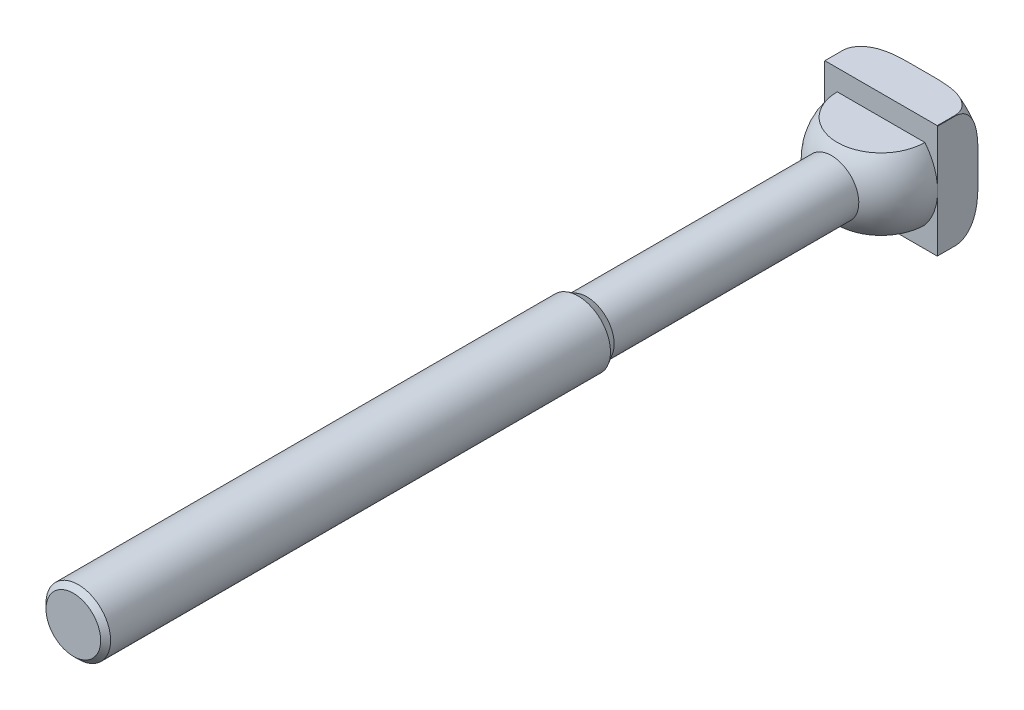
ISO-10303-21;
HEADER;
FILE_DESCRIPTION(('STEP AP214'),'2;1');
FILE_NAME('part.step','',(''),(''),'','','');
FILE_SCHEMA(('AUTOMOTIVE_DESIGN { 1 0 10303 214 1 1 1 1 }'));
ENDSEC;
DATA;
#1=APPLICATION_CONTEXT('core data for automotive mechanical design processes');
#2=APPLICATION_PROTOCOL_DEFINITION('international standard','automotive_design',2000,#1);
#3=PRODUCT_CONTEXT('',#1,'mechanical');
#4=PRODUCT('Part','Part','',(#3));
#5=PRODUCT_RELATED_PRODUCT_CATEGORY('part','',(#4));
#6=PRODUCT_DEFINITION_FORMATION('','',#4);
#7=PRODUCT_DEFINITION_CONTEXT('part definition',#1,'design');
#8=PRODUCT_DEFINITION('design','',#6,#7);
#9=PRODUCT_DEFINITION_SHAPE('','',#8);
#10=(LENGTH_UNIT() NAMED_UNIT(*) SI_UNIT(.MILLI.,.METRE.));
#11=(NAMED_UNIT(*) PLANE_ANGLE_UNIT() SI_UNIT($,.RADIAN.));
#12=(NAMED_UNIT(*) SI_UNIT($,.STERADIAN.) SOLID_ANGLE_UNIT());
#13=UNCERTAINTY_MEASURE_WITH_UNIT(LENGTH_MEASURE(1.E-05),#10,'distance_accuracy_value','');
#14=(GEOMETRIC_REPRESENTATION_CONTEXT(3) GLOBAL_UNCERTAINTY_ASSIGNED_CONTEXT((#13)) GLOBAL_UNIT_ASSIGNED_CONTEXT((#10,
#11,#12)) REPRESENTATION_CONTEXT('',''));
#15=CARTESIAN_POINT('',(0.,0.,0.));
#16=DIRECTION('',(0.,0.,1.));
#17=DIRECTION('',(1.,0.,0.));
#18=AXIS2_PLACEMENT_3D('',#15,#16,#17);
#19=CARTESIAN_POINT('',(0.,0.,-4.40000000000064));
#20=DIRECTION('',(0.,0.,-1.));
#21=DIRECTION('',(0.,-1.,0.));
#22=AXIS2_PLACEMENT_3D('',#19,#20,#21);
#23=TOROIDAL_SURFACE('',#22,14.1400000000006,5.59999999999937);
#24=CARTESIAN_POINT('',(-14.,0.,-9.99824972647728));
#25=CARTESIAN_POINT('',(-14.,-0.310759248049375,-9.99825085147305));
#26=CARTESIAN_POINT('',(-14.,-0.621518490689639,-9.99853784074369));
#27=CARTESIAN_POINT('',(-14.,-1.24303661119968,-9.99934060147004));
#28=CARTESIAN_POINT('',(-14.,-1.55379548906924,-9.99985637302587));
#29=CARTESIAN_POINT('',(-14.,-2.17555675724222,-10.0000957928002));
#30=CARTESIAN_POINT('',(-14.,-2.4865591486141,-9.99981882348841));
#31=CARTESIAN_POINT('',(-14.,-3.10856376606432,-9.9968399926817));
#32=CARTESIAN_POINT('',(-14.,-3.41956599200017,-9.99413807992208));
#33=CARTESIAN_POINT('',(-14.,-4.04142447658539,-9.98415314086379));
#34=CARTESIAN_POINT('',(-14.,-4.35228075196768,-9.97687135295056));
#35=CARTESIAN_POINT('',(-14.,-4.97375164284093,-9.95513103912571));
#36=CARTESIAN_POINT('',(-14.,-5.28436626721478,-9.94067279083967));
#37=CARTESIAN_POINT('',(-14.,-5.90457312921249,-9.90163480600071));
#38=CARTESIAN_POINT('',(-14.,-6.21416618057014,-9.87706873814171));
#39=CARTESIAN_POINT('',(-14.,-6.83210242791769,-9.81452432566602));
#40=CARTESIAN_POINT('',(-14.,-7.14044538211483,-9.77654350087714));
#41=CARTESIAN_POINT('',(-14.,-7.7603772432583,-9.68271738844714));
#42=CARTESIAN_POINT('',(-14.,-8.07191904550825,-9.62655135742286));
#43=CARTESIAN_POINT('',(-14.,-8.6902315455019,-9.49254678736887));
#44=CARTESIAN_POINT('',(-14.,-8.99700487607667,-9.41472069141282));
#45=CARTESIAN_POINT('',(-14.,-9.60149117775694,-9.23352582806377));
#46=CARTESIAN_POINT('',(-14.,-9.89923995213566,-9.13027881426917));
#47=CARTESIAN_POINT('',(-14.,-10.4824504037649,-8.89388231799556));
#48=CARTESIAN_POINT('',(-14.,-10.7679262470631,-8.76076847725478));
#49=CARTESIAN_POINT('',(-14.,-11.3136573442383,-8.46441782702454));
#50=CARTESIAN_POINT('',(-14.,-11.5743689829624,-8.30203188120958));
#51=CARTESIAN_POINT('',(-14.,-12.0709995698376,-7.94177662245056));
#52=CARTESIAN_POINT('',(-14.,-12.3068984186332,-7.74387888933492));
#53=CARTESIAN_POINT('',(-14.,-12.6351816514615,-7.41887852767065));
#54=CARTESIAN_POINT('',(-14.,-12.7408989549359,-7.30509090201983));
#55=CARTESIAN_POINT('',(-14.,-12.941686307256,-7.06851889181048));
#56=CARTESIAN_POINT('',(-14.,-13.0367621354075,-6.94573945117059));
#57=CARTESIAN_POINT('',(-14.,-13.2145748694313,-6.69177024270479));
#58=CARTESIAN_POINT('',(-14.,-13.2973291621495,-6.56059270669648));
#59=CARTESIAN_POINT('',(-14.,-13.449016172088,-6.29054624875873));
#60=CARTESIAN_POINT('',(-14.,-13.5179540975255,-6.15168025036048));
#61=CARTESIAN_POINT('',(-14.,-13.6697783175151,-5.79932831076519));
#62=CARTESIAN_POINT('',(-14.,-13.7436357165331,-5.5818412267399));
#63=CARTESIAN_POINT('',(-14.,-13.8537149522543,-5.1376226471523));
#64=CARTESIAN_POINT('',(-14.,-13.8899558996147,-4.91089590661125));
#65=CARTESIAN_POINT('',(-14.,-13.9227119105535,-4.45413617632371));
#66=CARTESIAN_POINT('',(-14.,-13.919155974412,-4.22409800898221));
#67=CARTESIAN_POINT('',(-14.,-13.8723552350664,-3.76811077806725));
#68=CARTESIAN_POINT('',(-14.,-13.8291052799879,-3.54216224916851));
#69=CARTESIAN_POINT('',(-14.,-13.7070151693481,-3.10597064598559));
#70=CARTESIAN_POINT('',(-14.,-13.6290387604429,-2.8954828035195));
#71=CARTESIAN_POINT('',(-14.,-13.4418093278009,-2.48903531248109));
#72=CARTESIAN_POINT('',(-14.,-13.3325526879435,-2.29307734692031));
#73=CARTESIAN_POINT('',(-14.,-13.0760306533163,-1.90105488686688));
#74=CARTESIAN_POINT('',(-14.,-12.9261604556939,-1.70670634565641));
#75=CARTESIAN_POINT('',(-14.,-12.6009114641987,-1.34062905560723));
#76=CARTESIAN_POINT('',(-14.,-12.4255104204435,-1.16892028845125));
#77=CARTESIAN_POINT('',(-14.,-12.0933369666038,-0.881603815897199));
#78=CARTESIAN_POINT('',(-14.,-11.940194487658,-0.761732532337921));
#79=CARTESIAN_POINT('',(-14.,-11.6238593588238,-0.535952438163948));
#80=CARTESIAN_POINT('',(-14.,-11.4606616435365,-0.430050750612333));
#81=CARTESIAN_POINT('',(-14.,-11.1262197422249,-0.231514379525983));
#82=CARTESIAN_POINT('',(-14.,-10.9549677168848,-0.138892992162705));
#83=CARTESIAN_POINT('',(-14.,-10.6063402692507,0.0338060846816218));
#84=CARTESIAN_POINT('',(-14.,-10.4289659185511,0.113885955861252));
#85=CARTESIAN_POINT('',(-14.,-9.95291874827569,0.310667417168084));
#86=CARTESIAN_POINT('',(-14.,-9.65013791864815,0.417465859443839));
#87=CARTESIAN_POINT('',(-14.,-9.0363810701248,0.604202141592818));
#88=CARTESIAN_POINT('',(-14.,-8.72539881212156,0.684118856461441));
#89=CARTESIAN_POINT('',(-14.,-8.09734857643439,0.82177392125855));
#90=CARTESIAN_POINT('',(-14.,-7.78026113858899,0.879421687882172));
#91=CARTESIAN_POINT('',(-14.,-7.14352292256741,0.976351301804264));
#92=CARTESIAN_POINT('',(-14.,-6.82387330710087,1.01564104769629));
#93=CARTESIAN_POINT('',(-14.,-6.08602362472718,1.08964790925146));
#94=CARTESIAN_POINT('',(-14.,-5.66733893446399,1.11936358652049));
#95=CARTESIAN_POINT('',(-14.,-4.82908628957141,1.16245287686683));
#96=CARTESIAN_POINT('',(-14.,-4.40951805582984,1.1758201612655));
#97=CARTESIAN_POINT('',(-14.,-3.56968565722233,1.1930302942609));
#98=CARTESIAN_POINT('',(-14.,-3.14942129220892,1.19686084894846));
#99=CARTESIAN_POINT('',(-14.,-2.30895829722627,1.20041358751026));
#100=CARTESIAN_POINT('',(-14.,-1.88875966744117,1.20013642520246));
#101=CARTESIAN_POINT('',(-14.,-1.04864396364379,1.1991509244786));
#102=CARTESIAN_POINT('',(-14.,-0.628726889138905,1.19844287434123));
#103=CARTESIAN_POINT('',(-14.,0.211127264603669,1.19813401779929));
#104=CARTESIAN_POINT('',(-14.,0.631064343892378,1.1985332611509));
#105=CARTESIAN_POINT('',(-14.,1.4706821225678,1.19965885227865));
#106=CARTESIAN_POINT('',(-14.,1.89036282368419,1.20038500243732));
#107=CARTESIAN_POINT('',(-14.,2.72971643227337,1.19918094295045));
#108=CARTESIAN_POINT('',(-14.,3.14938933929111,1.19725084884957));
#109=CARTESIAN_POINT('',(-14.,3.72184106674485,1.18945550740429));
#110=CARTESIAN_POINT('',(-14.,3.87466005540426,1.18687249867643));
#111=CARTESIAN_POINT('',(-14.,4.18027065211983,1.18040049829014));
#112=CARTESIAN_POINT('',(-14.,4.33306226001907,1.17651149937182));
#113=CARTESIAN_POINT('',(-14.,4.79139482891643,1.16242966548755));
#114=CARTESIAN_POINT('',(-14.,5.09687074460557,1.14982221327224));
#115=CARTESIAN_POINT('',(-14.,5.70773033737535,1.11539646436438));
#116=CARTESIAN_POINT('',(-14.,6.01311337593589,1.09356619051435));
#117=CARTESIAN_POINT('',(-14.,6.62278129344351,1.03760824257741));
#118=CARTESIAN_POINT('',(-14.,6.92706622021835,1.00348111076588));
#119=CARTESIAN_POINT('',(-14.,7.53756680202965,0.919002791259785));
#120=CARTESIAN_POINT('',(-14.,7.84375430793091,0.868441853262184));
#121=CARTESIAN_POINT('',(-14.,8.45235679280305,0.747440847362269));
#122=CARTESIAN_POINT('',(-14.,8.75477072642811,0.676995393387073));
#123=CARTESIAN_POINT('',(-14.,9.35221826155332,0.512485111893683));
#124=CARTESIAN_POINT('',(-14.,9.64727195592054,0.418494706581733));
#125=CARTESIAN_POINT('',(-14.,10.2269376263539,0.202797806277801));
#126=CARTESIAN_POINT('',(-14.,10.5115593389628,0.0811179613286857));
#127=CARTESIAN_POINT('',(-14.,11.0732457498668,-0.197865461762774));
#128=CARTESIAN_POINT('',(-14.,11.3498592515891,-0.356091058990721));
#129=CARTESIAN_POINT('',(-14.,11.8788610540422,-0.709917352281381));
#130=CARTESIAN_POINT('',(-14.,12.1312420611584,-0.905529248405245));
#131=CARTESIAN_POINT('',(-14.,12.484569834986,-1.22925474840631));
#132=CARTESIAN_POINT('',(-14.,12.5987850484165,-1.34304039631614));
#133=CARTESIAN_POINT('',(-14.,12.8164661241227,-1.58042428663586));
#134=CARTESIAN_POINT('',(-14.,12.9199380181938,-1.70401695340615));
#135=CARTESIAN_POINT('',(-14.,13.1142800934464,-1.96051354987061));
#136=CARTESIAN_POINT('',(-14.,13.2051678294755,-2.09340411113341));
#137=CARTESIAN_POINT('',(-14.,13.3726645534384,-2.36782024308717));
#138=CARTESIAN_POINT('',(-14.,13.4492796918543,-2.50934205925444));
#139=CARTESIAN_POINT('',(-14.,13.616341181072,-2.8631997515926));
#140=CARTESIAN_POINT('',(-14.,13.6983634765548,-3.07961651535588));
#141=CARTESIAN_POINT('',(-14.,13.8249239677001,-3.52306568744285));
#142=CARTESIAN_POINT('',(-14.,13.8694841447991,-3.75009178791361));
#143=CARTESIAN_POINT('',(-14.,13.9185610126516,-4.20903331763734));
#144=CARTESIAN_POINT('',(-14.,13.92298355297,-4.44095896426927));
#145=CARTESIAN_POINT('',(-14.,13.8912351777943,-4.90200336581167));
#146=CARTESIAN_POINT('',(-14.,13.8550611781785,-5.13112190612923));
#147=CARTESIAN_POINT('',(-14.,13.7462858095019,-5.57215944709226));
#148=CARTESIAN_POINT('',(-14.,13.6749635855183,-5.78439832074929));
#149=CARTESIAN_POINT('',(-14.,13.5003447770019,-6.19518406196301));
#150=CARTESIAN_POINT('',(-14.,13.3970432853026,-6.39372882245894));
#151=CARTESIAN_POINT('',(-14.,13.1534590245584,-6.78957755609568));
#152=CARTESIAN_POINT('',(-14.,13.0108272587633,-6.98542587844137));
#153=CARTESIAN_POINT('',(-14.,12.699599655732,-7.35524295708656));
#154=CARTESIAN_POINT('',(-14.,12.5309874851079,-7.52919782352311));
#155=CARTESIAN_POINT('',(-14.,12.2128466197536,-7.81886907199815));
#156=CARTESIAN_POINT('',(-14.,12.0672621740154,-7.93898454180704));
#157=CARTESIAN_POINT('',(-14.,11.7660321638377,-8.16591189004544));
#158=CARTESIAN_POINT('',(-14.,11.6103820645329,-8.27271770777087));
#159=CARTESIAN_POINT('',(-14.,11.1309674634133,-8.57419374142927));
#160=CARTESIAN_POINT('',(-14.,10.7950194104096,-8.74967609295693));
#161=CARTESIAN_POINT('',(-14.,10.1706537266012,-9.02589055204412));
#162=CARTESIAN_POINT('',(-14.,9.88556746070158,-9.13451214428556));
#163=CARTESIAN_POINT('',(-14.,9.30681398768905,-9.3264233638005));
#164=CARTESIAN_POINT('',(-14.,9.0131406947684,-9.40969452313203));
#165=CARTESIAN_POINT('',(-14.,8.42011381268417,-9.55475710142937));
#166=CARTESIAN_POINT('',(-14.,8.12075104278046,-9.61651002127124));
#167=CARTESIAN_POINT('',(-14.,7.51883351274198,-9.72211873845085));
#168=CARTESIAN_POINT('',(-14.,7.21627753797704,-9.76596745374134));
#169=CARTESIAN_POINT('',(-14.,6.62682275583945,-9.83715592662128));
#170=CARTESIAN_POINT('',(-14.,6.34001723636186,-9.86529590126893));
#171=CARTESIAN_POINT('',(-14.,5.76566600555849,-9.91149411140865));
#172=CARTESIAN_POINT('',(-14.,5.47812040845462,-9.92955381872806));
#173=CARTESIAN_POINT('',(-14.,4.90241848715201,-9.95811498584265));
#174=CARTESIAN_POINT('',(-14.,4.61426184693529,-9.96860968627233));
#175=CARTESIAN_POINT('',(-14.,4.03780736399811,-9.98427067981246));
#176=CARTESIAN_POINT('',(-14.,3.74950951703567,-9.98943680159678));
#177=CARTESIAN_POINT('',(-14.,3.17268829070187,-9.99640544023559));
#178=CARTESIAN_POINT('',(-14.,2.884164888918,-9.99820571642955));
#179=CARTESIAN_POINT('',(-14.,2.30711989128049,-10.0000585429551));
#180=CARTESIAN_POINT('',(-14.,2.01859829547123,-10.0001111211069));
#181=CARTESIAN_POINT('',(-14.,1.44173081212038,-9.99968852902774));
#182=CARTESIAN_POINT('',(-14.,1.15338492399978,-9.99921367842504));
#183=CARTESIAN_POINT('',(-14.,0.576692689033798,-9.99849375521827));
#184=CARTESIAN_POINT('',(-14.,0.288346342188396,-9.99824868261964));
#185=CARTESIAN_POINT('',(-14.,0.,-9.99824972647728));
#186=B_SPLINE_CURVE_WITH_KNOTS('',3,(#24,#25,#26,#27,#28,#29,#30,#31,#32,#33,#34,#35,#36,#37,
#38,#39,#40,#41,#42,#43,#44,#45,#46,#47,#48,#49,#50,#51,#52,#53,#54,#55,#56,#57,#58,#59,#60,#61,
#62,#63,#64,#65,#66,#67,#68,#69,#70,#71,#72,#73,#74,#75,#76,#77,#78,#79,#80,#81,#82,#83,#84,#85,
#86,#87,#88,#89,#90,#91,#92,#93,#94,#95,#96,#97,#98,#99,#100,#101,#102,#103,#104,#105,#106,#107,
#108,#109,#110,#111,#112,#113,#114,#115,#116,#117,#118,#119,#120,#121,#122,#123,#124,#125,#126,
#127,#128,#129,#130,#131,#132,#133,#134,#135,#136,#137,#138,#139,#140,#141,#142,#143,#144,#145,
#146,#147,#148,#149,#150,#151,#152,#153,#154,#155,#156,#157,#158,#159,#160,#161,#162,#163,#164,
#165,#166,#167,#168,#169,#170,#171,#172,#173,#174,#175,#176,#177,#178,#179,#180,#181,#182,#183,
#184,#185),.UNSPECIFIED.,.T.,.F.,(4,2,2,2,2,2,2,2,2,2,2,2,2,2,2,2,2,2,2,2,2,2,2,2,2,2,2,2,2,2,2,
2,2,2,2,2,2,2,2,2,2,2,2,2,2,2,2,2,2,2,2,2,2,2,2,2,2,2,2,2,2,2,2,2,2,2,2,2,2,2,2,2,2,2,2,2,2,2,2,
2,4),(0.,0.932277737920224,1.864555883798,2.79756045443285,3.73058474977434,4.66335686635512,
5.59609290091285,6.52757173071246,7.45922286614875,8.40829357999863,9.35682020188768,
10.3008893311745,11.2438377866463,12.162838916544,13.0825788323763,13.5480143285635,
14.0131958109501,14.4777145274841,14.942057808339,15.6278649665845,16.3133235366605,
17.0000051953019,17.6867759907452,18.3573439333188,19.0279894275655,19.7615747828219,
20.495803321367,21.0784512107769,21.6613950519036,22.2449185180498,22.8283403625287,
23.7898904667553,24.7521944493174,25.7183725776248,26.6841346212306,27.9428211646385,
29.2019948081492,30.462790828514,31.7233861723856,32.9831390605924,34.2429485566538,
35.5019975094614,36.7609916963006,37.2195087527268,37.6780283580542,38.5951359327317,
39.5134381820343,40.4316999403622,41.3621750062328,42.2929023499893,43.2207241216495,
44.1476566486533,45.1011871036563,46.0550036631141,46.5381223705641,47.0209683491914,
47.5031338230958,47.9850910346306,48.6761799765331,49.3668631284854,50.0591659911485,
50.7515214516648,51.4203582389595,52.0892977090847,52.813462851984,53.5380851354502,
54.103530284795,54.669231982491,55.8017422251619,56.7158020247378,57.630526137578,
58.5468785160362,59.4635930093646,60.3279216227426,61.1921240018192,62.0570975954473,
62.9220989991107,63.7876760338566,64.6532392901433,65.5182782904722,66.3833173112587),.UNSPECIFIED.);
#187=CARTESIAN_POINT('',(-14.,-1.98484256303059,-10.));
#188=VERTEX_POINT('',#187);
#189=CARTESIAN_POINT('',(-14.,-13.916450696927,-4.4));
#190=VERTEX_POINT('',#189);
#191=EDGE_CURVE('E262',#188,#190,#186,.T.);
#192=ORIENTED_EDGE('',*,*,#191,.F.);
#193=CARTESIAN_POINT('',(0.,0.,-10.));
#194=DIRECTION('',(0.,0.,-1.));
#195=DIRECTION('',(0.,-1.,0.));
#196=AXIS2_PLACEMENT_3D('',#193,#194,#195);
#197=CIRCLE('',#196,14.14);
#198=CARTESIAN_POINT('',(-1.98484256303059,-14.,-10.));
#199=VERTEX_POINT('',#198);
#200=EDGE_CURVE('E265',#199,#188,#197,.T.);
#201=ORIENTED_EDGE('',*,*,#200,.F.);
#202=CARTESIAN_POINT('',(0.,-14.,-9.99824972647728));
#203=CARTESIAN_POINT('',(0.310759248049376,-14.,-9.99825085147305));
#204=CARTESIAN_POINT('',(0.621518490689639,-14.,-9.99853784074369));
#205=CARTESIAN_POINT('',(1.24303661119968,-14.,-9.99934060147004));
#206=CARTESIAN_POINT('',(1.55379548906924,-14.,-9.99985637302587));
#207=CARTESIAN_POINT('',(2.17555675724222,-14.,-10.0000957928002));
#208=CARTESIAN_POINT('',(2.4865591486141,-14.,-9.99981882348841));
#209=CARTESIAN_POINT('',(3.10856376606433,-14.,-9.9968399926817));
#210=CARTESIAN_POINT('',(3.41956599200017,-14.,-9.99413807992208));
#211=CARTESIAN_POINT('',(4.04142447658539,-14.,-9.98415314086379));
#212=CARTESIAN_POINT('',(4.35228075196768,-14.,-9.97687135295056));
#213=CARTESIAN_POINT('',(4.97375164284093,-14.,-9.95513103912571));
#214=CARTESIAN_POINT('',(5.28436626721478,-14.,-9.94067279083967));
#215=CARTESIAN_POINT('',(5.90457312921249,-14.,-9.90163480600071));
#216=CARTESIAN_POINT('',(6.21416618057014,-14.,-9.87706873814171));
#217=CARTESIAN_POINT('',(6.83210242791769,-14.,-9.81452432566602));
#218=CARTESIAN_POINT('',(7.14044538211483,-14.,-9.77654350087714));
#219=CARTESIAN_POINT('',(7.7603772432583,-14.,-9.68271738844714));
#220=CARTESIAN_POINT('',(8.07191904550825,-14.,-9.62655135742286));
#221=CARTESIAN_POINT('',(8.6902315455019,-14.,-9.49254678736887));
#222=CARTESIAN_POINT('',(8.99700487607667,-14.,-9.41472069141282));
#223=CARTESIAN_POINT('',(9.60149117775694,-14.,-9.23352582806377));
#224=CARTESIAN_POINT('',(9.89923995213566,-14.,-9.13027881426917));
#225=CARTESIAN_POINT('',(10.4824504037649,-14.,-8.89388231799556));
#226=CARTESIAN_POINT('',(10.7679262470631,-14.,-8.76076847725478));
#227=CARTESIAN_POINT('',(11.3136573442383,-14.,-8.46441782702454));
#228=CARTESIAN_POINT('',(11.5743689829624,-14.,-8.30203188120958));
#229=CARTESIAN_POINT('',(12.0709995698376,-14.,-7.94177662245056));
#230=CARTESIAN_POINT('',(12.3068984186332,-14.,-7.74387888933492));
#231=CARTESIAN_POINT('',(12.6351816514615,-14.,-7.41887852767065));
#232=CARTESIAN_POINT('',(12.7408989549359,-14.,-7.30509090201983));
#233=CARTESIAN_POINT('',(12.941686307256,-14.,-7.06851889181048));
#234=CARTESIAN_POINT('',(13.0367621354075,-14.,-6.94573945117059));
#235=CARTESIAN_POINT('',(13.2145748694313,-14.,-6.69177024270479));
#236=CARTESIAN_POINT('',(13.2973291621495,-14.,-6.56059270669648));
#237=CARTESIAN_POINT('',(13.449016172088,-14.,-6.29054624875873));
#238=CARTESIAN_POINT('',(13.5179540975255,-14.,-6.15168025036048));
#239=CARTESIAN_POINT('',(13.6697783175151,-14.,-5.79932831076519));
#240=CARTESIAN_POINT('',(13.7436357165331,-14.,-5.5818412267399));
#241=CARTESIAN_POINT('',(13.8537149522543,-14.,-5.1376226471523));
#242=CARTESIAN_POINT('',(13.8899558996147,-14.,-4.91089590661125));
#243=CARTESIAN_POINT('',(13.9227119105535,-14.,-4.45413617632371));
#244=CARTESIAN_POINT('',(13.919155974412,-14.,-4.22409800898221));
#245=CARTESIAN_POINT('',(13.8723552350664,-14.,-3.76811077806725));
#246=CARTESIAN_POINT('',(13.8291052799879,-14.,-3.54216224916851));
#247=CARTESIAN_POINT('',(13.7070151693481,-14.,-3.10597064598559));
#248=CARTESIAN_POINT('',(13.6290387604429,-14.,-2.8954828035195));
#249=CARTESIAN_POINT('',(13.4418093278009,-14.,-2.48903531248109));
#250=CARTESIAN_POINT('',(13.3325526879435,-14.,-2.29307734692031));
#251=CARTESIAN_POINT('',(13.0760306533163,-14.,-1.90105488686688));
#252=CARTESIAN_POINT('',(12.9261604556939,-14.,-1.70670634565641));
#253=CARTESIAN_POINT('',(12.6009114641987,-14.,-1.34062905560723));
#254=CARTESIAN_POINT('',(12.4255104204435,-14.,-1.16892028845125));
#255=CARTESIAN_POINT('',(12.0933369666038,-14.,-0.881603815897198));
#256=CARTESIAN_POINT('',(11.940194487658,-14.,-0.761732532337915));
#257=CARTESIAN_POINT('',(11.6238593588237,-14.,-0.535952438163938));
#258=CARTESIAN_POINT('',(11.4606616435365,-14.,-0.430050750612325));
#259=CARTESIAN_POINT('',(11.1262197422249,-14.,-0.231514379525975));
#260=CARTESIAN_POINT('',(10.9549677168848,-14.,-0.138892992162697));
#261=CARTESIAN_POINT('',(10.6063402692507,-14.,0.0338060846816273));
#262=CARTESIAN_POINT('',(10.4289659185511,-14.,0.113885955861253));
#263=CARTESIAN_POINT('',(9.95291874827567,-14.,0.310667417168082));
#264=CARTESIAN_POINT('',(9.65013791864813,-14.,0.417465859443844));
#265=CARTESIAN_POINT('',(9.03638107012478,-14.,0.604202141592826));
#266=CARTESIAN_POINT('',(8.72539881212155,-14.,0.684118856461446));
#267=CARTESIAN_POINT('',(8.09734857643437,-14.,0.821773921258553));
#268=CARTESIAN_POINT('',(7.78026113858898,-14.,0.879421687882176));
#269=CARTESIAN_POINT('',(7.1435229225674,-14.,0.976351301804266));
#270=CARTESIAN_POINT('',(6.82387330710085,-14.,1.01564104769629));
#271=CARTESIAN_POINT('',(6.08602362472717,-14.,1.08964790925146));
#272=CARTESIAN_POINT('',(5.66733893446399,-14.,1.11936358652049));
#273=CARTESIAN_POINT('',(4.82908628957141,-14.,1.16245287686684));
#274=CARTESIAN_POINT('',(4.40951805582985,-14.,1.1758201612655));
#275=CARTESIAN_POINT('',(3.56968565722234,-14.,1.1930302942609));
#276=CARTESIAN_POINT('',(3.14942129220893,-14.,1.19686084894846));
#277=CARTESIAN_POINT('',(2.30895829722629,-14.,1.20041358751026));
#278=CARTESIAN_POINT('',(1.8887596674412,-14.,1.20013642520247));
#279=CARTESIAN_POINT('',(1.04864396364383,-14.,1.1991509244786));
#280=CARTESIAN_POINT('',(0.628726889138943,-14.,1.19844287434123));
#281=CARTESIAN_POINT('',(-0.211127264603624,-14.,1.19813401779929));
#282=CARTESIAN_POINT('',(-0.631064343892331,-14.,1.1985332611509));
#283=CARTESIAN_POINT('',(-1.47068212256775,-14.,1.19965885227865));
#284=CARTESIAN_POINT('',(-1.89036282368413,-14.,1.20038500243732));
#285=CARTESIAN_POINT('',(-2.7297164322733,-14.,1.19918094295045));
#286=CARTESIAN_POINT('',(-3.14938933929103,-14.,1.19725084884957));
#287=CARTESIAN_POINT('',(-3.72184106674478,-14.,1.18945550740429));
#288=CARTESIAN_POINT('',(-3.87466005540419,-14.,1.18687249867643));
#289=CARTESIAN_POINT('',(-4.18027065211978,-14.,1.18040049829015));
#290=CARTESIAN_POINT('',(-4.33306226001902,-14.,1.17651149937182));
#291=CARTESIAN_POINT('',(-4.79139482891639,-14.,1.16242966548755));
#292=CARTESIAN_POINT('',(-5.09687074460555,-14.,1.14982221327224));
#293=CARTESIAN_POINT('',(-5.70773033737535,-14.,1.11539646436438));
#294=CARTESIAN_POINT('',(-6.01311337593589,-14.,1.09356619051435));
#295=CARTESIAN_POINT('',(-6.62278129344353,-14.,1.03760824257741));
#296=CARTESIAN_POINT('',(-6.92706622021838,-14.,1.00348111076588));
#297=CARTESIAN_POINT('',(-7.5375668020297,-14.,0.919002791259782));
#298=CARTESIAN_POINT('',(-7.84375430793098,-14.,0.868441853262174));
#299=CARTESIAN_POINT('',(-8.45235679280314,-14.,0.747440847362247));
#300=CARTESIAN_POINT('',(-8.7547707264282,-14.,0.676995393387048));
#301=CARTESIAN_POINT('',(-9.35221826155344,-14.,0.512485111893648));
#302=CARTESIAN_POINT('',(-9.64727195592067,-14.,0.41849470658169));
#303=CARTESIAN_POINT('',(-10.2269376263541,-14.,0.202797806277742));
#304=CARTESIAN_POINT('',(-10.511559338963,-14.,0.081117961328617));
#305=CARTESIAN_POINT('',(-11.0732457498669,-14.,-0.197865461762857));
#306=CARTESIAN_POINT('',(-11.3498592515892,-14.,-0.356091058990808));
#307=CARTESIAN_POINT('',(-11.8788610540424,-14.,-0.709917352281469));
#308=CARTESIAN_POINT('',(-12.1312420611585,-14.,-0.905529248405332));
#309=CARTESIAN_POINT('',(-12.4845698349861,-14.,-1.2292547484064));
#310=CARTESIAN_POINT('',(-12.5987850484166,-14.,-1.34304039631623));
#311=CARTESIAN_POINT('',(-12.8164661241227,-14.,-1.58042428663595));
#312=CARTESIAN_POINT('',(-12.9199380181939,-14.,-1.70401695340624));
#313=CARTESIAN_POINT('',(-13.1142800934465,-14.,-1.9605135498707));
#314=CARTESIAN_POINT('',(-13.2051678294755,-14.,-2.0934041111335));
#315=CARTESIAN_POINT('',(-13.3726645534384,-14.,-2.36782024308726));
#316=CARTESIAN_POINT('',(-13.4492796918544,-14.,-2.50934205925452));
#317=CARTESIAN_POINT('',(-13.6163411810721,-14.,-2.86319975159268));
#318=CARTESIAN_POINT('',(-13.6983634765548,-14.,-3.07961651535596));
#319=CARTESIAN_POINT('',(-13.8249239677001,-14.,-3.52306568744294));
#320=CARTESIAN_POINT('',(-13.8694841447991,-14.,-3.7500917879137));
#321=CARTESIAN_POINT('',(-13.9185610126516,-14.,-4.20903331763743));
#322=CARTESIAN_POINT('',(-13.92298355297,-14.,-4.44095896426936));
#323=CARTESIAN_POINT('',(-13.8912351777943,-14.,-4.90200336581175));
#324=CARTESIAN_POINT('',(-13.8550611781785,-14.,-5.13112190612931));
#325=CARTESIAN_POINT('',(-13.7462858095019,-14.,-5.57215944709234));
#326=CARTESIAN_POINT('',(-13.6749635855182,-14.,-5.78439832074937));
#327=CARTESIAN_POINT('',(-13.5003447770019,-14.,-6.19518406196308));
#328=CARTESIAN_POINT('',(-13.3970432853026,-14.,-6.39372882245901));
#329=CARTESIAN_POINT('',(-13.1534590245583,-14.,-6.78957755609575));
#330=CARTESIAN_POINT('',(-13.0108272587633,-14.,-6.98542587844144));
#331=CARTESIAN_POINT('',(-12.6995996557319,-14.,-7.35524295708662));
#332=CARTESIAN_POINT('',(-12.5309874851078,-14.,-7.52919782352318));
#333=CARTESIAN_POINT('',(-12.2128466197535,-14.,-7.81886907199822));
#334=CARTESIAN_POINT('',(-12.0672621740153,-14.,-7.93898454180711));
#335=CARTESIAN_POINT('',(-11.7660321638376,-14.,-8.16591189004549));
#336=CARTESIAN_POINT('',(-11.6103820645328,-14.,-8.27271770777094));
#337=CARTESIAN_POINT('',(-11.1309674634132,-14.,-8.57419374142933));
#338=CARTESIAN_POINT('',(-10.7950194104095,-14.,-8.74967609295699));
#339=CARTESIAN_POINT('',(-10.170653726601,-14.,-9.02589055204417));
#340=CARTESIAN_POINT('',(-9.88556746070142,-14.,-9.13451214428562));
#341=CARTESIAN_POINT('',(-9.30681398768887,-14.,-9.32642336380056));
#342=CARTESIAN_POINT('',(-9.01314069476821,-14.,-9.40969452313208));
#343=CARTESIAN_POINT('',(-8.42011381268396,-14.,-9.55475710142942));
#344=CARTESIAN_POINT('',(-8.12075104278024,-14.,-9.61651002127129));
#345=CARTESIAN_POINT('',(-7.51883351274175,-14.,-9.72211873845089));
#346=CARTESIAN_POINT('',(-7.2162775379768,-14.,-9.76596745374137));
#347=CARTESIAN_POINT('',(-6.6268227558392,-14.,-9.8371559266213));
#348=CARTESIAN_POINT('',(-6.34001723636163,-14.,-9.86529590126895));
#349=CARTESIAN_POINT('',(-5.76566600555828,-14.,-9.91149411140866));
#350=CARTESIAN_POINT('',(-5.47812040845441,-14.,-9.92955381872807));
#351=CARTESIAN_POINT('',(-4.90241848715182,-14.,-9.95811498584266));
#352=CARTESIAN_POINT('',(-4.61426184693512,-14.,-9.96860968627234));
#353=CARTESIAN_POINT('',(-4.03780736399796,-14.,-9.98427067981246));
#354=CARTESIAN_POINT('',(-3.74950951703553,-14.,-9.98943680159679));
#355=CARTESIAN_POINT('',(-3.17268829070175,-14.,-9.99640544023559));
#356=CARTESIAN_POINT('',(-2.88416488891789,-14.,-9.99820571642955));
#357=CARTESIAN_POINT('',(-2.3071198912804,-14.,-10.0000585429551));
#358=CARTESIAN_POINT('',(-2.01859829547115,-14.,-10.0001111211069));
#359=CARTESIAN_POINT('',(-1.44173081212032,-14.,-9.99968852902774));
#360=CARTESIAN_POINT('',(-1.15338492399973,-14.,-9.99921367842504));
#361=CARTESIAN_POINT('',(-0.57669268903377,-14.,-9.99849375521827));
#362=CARTESIAN_POINT('',(-0.288346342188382,-14.,-9.99824868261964));
#363=CARTESIAN_POINT('',(0.,-14.,-9.99824972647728));
#364=B_SPLINE_CURVE_WITH_KNOTS('',3,(#202,#203,#204,#205,#206,#207,#208,#209,#210,#211,#212,
#213,#214,#215,#216,#217,#218,#219,#220,#221,#222,#223,#224,#225,#226,#227,#228,#229,#230,#231,
#232,#233,#234,#235,#236,#237,#238,#239,#240,#241,#242,#243,#244,#245,#246,#247,#248,#249,#250,
#251,#252,#253,#254,#255,#256,#257,#258,#259,#260,#261,#262,#263,#264,#265,#266,#267,#268,#269,
#270,#271,#272,#273,#274,#275,#276,#277,#278,#279,#280,#281,#282,#283,#284,#285,#286,#287,#288,
#289,#290,#291,#292,#293,#294,#295,#296,#297,#298,#299,#300,#301,#302,#303,#304,#305,#306,#307,
#308,#309,#310,#311,#312,#313,#314,#315,#316,#317,#318,#319,#320,#321,#322,#323,#324,#325,#326,
#327,#328,#329,#330,#331,#332,#333,#334,#335,#336,#337,#338,#339,#340,#341,#342,#343,#344,#345,
#346,#347,#348,#349,#350,#351,#352,#353,#354,#355,#356,#357,#358,#359,#360,#361,#362,#363),
.UNSPECIFIED.,.T.,.F.,(4,2,2,2,2,2,2,2,2,2,2,2,2,2,2,2,2,2,2,2,2,2,2,2,2,2,2,2,2,2,2,2,2,2,2,2,
2,2,2,2,2,2,2,2,2,2,2,2,2,2,2,2,2,2,2,2,2,2,2,2,2,2,2,2,2,2,2,2,2,2,2,2,2,2,2,2,2,2,2,2,4),(0.,
0.932277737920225,1.864555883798,2.79756045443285,3.73058474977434,4.66335686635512,
5.59609290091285,6.52757173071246,7.45922286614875,8.40829357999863,9.35682020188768,
10.3008893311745,11.2438377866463,12.162838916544,13.0825788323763,13.5480143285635,
14.0131958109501,14.4777145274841,14.942057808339,15.6278649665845,16.3133235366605,
17.0000051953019,17.6867759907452,18.3573439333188,19.0279894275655,19.7615747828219,
20.4958033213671,21.0784512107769,21.6613950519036,22.2449185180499,22.8283403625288,
23.7898904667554,24.7521944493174,25.7183725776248,26.6841346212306,27.9428211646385,
29.2019948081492,30.462790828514,31.7233861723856,32.9831390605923,34.2429485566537,
35.5019975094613,36.7609916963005,37.2195087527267,37.6780283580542,38.5951359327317,
39.5134381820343,40.4316999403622,41.3621750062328,42.2929023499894,43.2207241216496,
44.1476566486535,45.1011871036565,46.0550036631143,46.5381223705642,47.0209683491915,
47.5031338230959,47.9850910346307,48.6761799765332,49.3668631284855,50.0591659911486,
50.7515214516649,51.4203582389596,52.0892977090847,52.813462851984,53.5380851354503,
54.1035302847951,54.6692319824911,55.801742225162,56.7158020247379,57.6305261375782,
58.5468785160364,59.4635930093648,60.3279216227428,61.1921240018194,62.0570975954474,
62.9220989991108,63.7876760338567,64.6532392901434,65.5182782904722,66.3833173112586),.UNSPECIFIED.);
#365=CARTESIAN_POINT('',(-13.916450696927,-14.,-4.4));
#366=VERTEX_POINT('',#365);
#367=EDGE_CURVE('E308',#366,#199,#364,.T.);
#368=ORIENTED_EDGE('',*,*,#367,.F.);
#369=CARTESIAN_POINT('',(0.,0.,-4.4));
#370=DIRECTION('',(0.,0.,-1.));
#371=DIRECTION('',(0.,-1.,0.));
#372=AXIS2_PLACEMENT_3D('',#369,#370,#371);
#373=CIRCLE('',#372,19.74);
#374=EDGE_CURVE('E167',#366,#190,#373,.T.);
#375=ORIENTED_EDGE('',*,*,#374,.T.);
#376=EDGE_LOOP('',(#192,#201,#368,#375));
#377=FACE_BOUND('',#376,.T.);
#378=ADVANCED_FACE('F14',(#377),#23,.T.);
#379=CARTESIAN_POINT('',(-14.,13.916450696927,-4.4));
#380=VERTEX_POINT('',#379);
#381=CARTESIAN_POINT('',(-14.,1.98484256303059,-10.));
#382=VERTEX_POINT('',#381);
#383=EDGE_CURVE('E269',#380,#382,#186,.T.);
#384=ORIENTED_EDGE('',*,*,#383,.F.);
#385=CARTESIAN_POINT('',(-13.916450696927,14.,-4.4));
#386=VERTEX_POINT('',#385);
#387=EDGE_CURVE('E288',#380,#386,#373,.T.);
#388=ORIENTED_EDGE('',*,*,#387,.T.);
#389=CARTESIAN_POINT('',(0.,14.,-9.99824972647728));
#390=CARTESIAN_POINT('',(-0.310759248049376,14.,-9.99825085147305));
#391=CARTESIAN_POINT('',(-0.621518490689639,14.,-9.99853784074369));
#392=CARTESIAN_POINT('',(-1.24303661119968,14.,-9.99934060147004));
#393=CARTESIAN_POINT('',(-1.55379548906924,14.,-9.99985637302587));
#394=CARTESIAN_POINT('',(-2.17555675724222,14.,-10.0000957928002));
#395=CARTESIAN_POINT('',(-2.4865591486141,14.,-9.99981882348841));
#396=CARTESIAN_POINT('',(-3.10856376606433,14.,-9.9968399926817));
#397=CARTESIAN_POINT('',(-3.41956599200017,14.,-9.99413807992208));
#398=CARTESIAN_POINT('',(-4.04142447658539,14.,-9.98415314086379));
#399=CARTESIAN_POINT('',(-4.35228075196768,14.,-9.97687135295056));
#400=CARTESIAN_POINT('',(-4.97375164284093,14.,-9.95513103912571));
#401=CARTESIAN_POINT('',(-5.28436626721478,14.,-9.94067279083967));
#402=CARTESIAN_POINT('',(-5.90457312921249,14.,-9.90163480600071));
#403=CARTESIAN_POINT('',(-6.21416618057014,14.,-9.87706873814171));
#404=CARTESIAN_POINT('',(-6.83210242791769,14.,-9.81452432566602));
#405=CARTESIAN_POINT('',(-7.14044538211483,14.,-9.77654350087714));
#406=CARTESIAN_POINT('',(-7.7603772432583,14.,-9.68271738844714));
#407=CARTESIAN_POINT('',(-8.07191904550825,14.,-9.62655135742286));
#408=CARTESIAN_POINT('',(-8.6902315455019,14.,-9.49254678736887));
#409=CARTESIAN_POINT('',(-8.99700487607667,14.,-9.41472069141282));
#410=CARTESIAN_POINT('',(-9.60149117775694,14.,-9.23352582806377));
#411=CARTESIAN_POINT('',(-9.89923995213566,14.,-9.13027881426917));
#412=CARTESIAN_POINT('',(-10.4824504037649,14.,-8.89388231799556));
#413=CARTESIAN_POINT('',(-10.7679262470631,14.,-8.76076847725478));
#414=CARTESIAN_POINT('',(-11.3136573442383,14.,-8.46441782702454));
#415=CARTESIAN_POINT('',(-11.5743689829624,14.,-8.30203188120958));
#416=CARTESIAN_POINT('',(-12.0709995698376,14.,-7.94177662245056));
#417=CARTESIAN_POINT('',(-12.3068984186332,14.,-7.74387888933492));
#418=CARTESIAN_POINT('',(-12.6351816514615,14.,-7.41887852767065));
#419=CARTESIAN_POINT('',(-12.7408989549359,14.,-7.30509090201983));
#420=CARTESIAN_POINT('',(-12.941686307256,14.,-7.06851889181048));
#421=CARTESIAN_POINT('',(-13.0367621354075,14.,-6.94573945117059));
#422=CARTESIAN_POINT('',(-13.2145748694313,14.,-6.69177024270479));
#423=CARTESIAN_POINT('',(-13.2973291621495,14.,-6.56059270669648));
#424=CARTESIAN_POINT('',(-13.449016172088,14.,-6.29054624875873));
#425=CARTESIAN_POINT('',(-13.5179540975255,14.,-6.15168025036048));
#426=CARTESIAN_POINT('',(-13.6697783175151,14.,-5.79932831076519));
#427=CARTESIAN_POINT('',(-13.7436357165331,14.,-5.5818412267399));
#428=CARTESIAN_POINT('',(-13.8537149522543,14.,-5.1376226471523));
#429=CARTESIAN_POINT('',(-13.8899558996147,14.,-4.91089590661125));
#430=CARTESIAN_POINT('',(-13.9227119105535,14.,-4.45413617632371));
#431=CARTESIAN_POINT('',(-13.919155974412,14.,-4.22409800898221));
#432=CARTESIAN_POINT('',(-13.8723552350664,14.,-3.76811077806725));
#433=CARTESIAN_POINT('',(-13.8291052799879,14.,-3.54216224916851));
#434=CARTESIAN_POINT('',(-13.7070151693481,14.,-3.10597064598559));
#435=CARTESIAN_POINT('',(-13.6290387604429,14.,-2.8954828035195));
#436=CARTESIAN_POINT('',(-13.4418093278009,14.,-2.48903531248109));
#437=CARTESIAN_POINT('',(-13.3325526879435,14.,-2.29307734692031));
#438=CARTESIAN_POINT('',(-13.0760306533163,14.,-1.90105488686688));
#439=CARTESIAN_POINT('',(-12.9261604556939,14.,-1.70670634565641));
#440=CARTESIAN_POINT('',(-12.6009114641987,14.,-1.34062905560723));
#441=CARTESIAN_POINT('',(-12.4255104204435,14.,-1.16892028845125));
#442=CARTESIAN_POINT('',(-12.0933369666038,14.,-0.881603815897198));
#443=CARTESIAN_POINT('',(-11.940194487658,14.,-0.761732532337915));
#444=CARTESIAN_POINT('',(-11.6238593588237,14.,-0.535952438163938));
#445=CARTESIAN_POINT('',(-11.4606616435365,14.,-0.430050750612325));
#446=CARTESIAN_POINT('',(-11.1262197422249,14.,-0.231514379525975));
#447=CARTESIAN_POINT('',(-10.9549677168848,14.,-0.138892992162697));
#448=CARTESIAN_POINT('',(-10.6063402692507,14.,0.0338060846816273));
#449=CARTESIAN_POINT('',(-10.4289659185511,14.,0.113885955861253));
#450=CARTESIAN_POINT('',(-9.95291874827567,14.,0.310667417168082));
#451=CARTESIAN_POINT('',(-9.65013791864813,14.,0.417465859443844));
#452=CARTESIAN_POINT('',(-9.03638107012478,14.,0.604202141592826));
#453=CARTESIAN_POINT('',(-8.72539881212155,14.,0.684118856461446));
#454=CARTESIAN_POINT('',(-8.09734857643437,14.,0.821773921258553));
#455=CARTESIAN_POINT('',(-7.78026113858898,14.,0.879421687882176));
#456=CARTESIAN_POINT('',(-7.1435229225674,14.,0.976351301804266));
#457=CARTESIAN_POINT('',(-6.82387330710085,14.,1.01564104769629));
#458=CARTESIAN_POINT('',(-6.08602362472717,14.,1.08964790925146));
#459=CARTESIAN_POINT('',(-5.66733893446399,14.,1.11936358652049));
#460=CARTESIAN_POINT('',(-4.82908628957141,14.,1.16245287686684));
#461=CARTESIAN_POINT('',(-4.40951805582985,14.,1.1758201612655));
#462=CARTESIAN_POINT('',(-3.56968565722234,14.,1.1930302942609));
#463=CARTESIAN_POINT('',(-3.14942129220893,14.,1.19686084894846));
#464=CARTESIAN_POINT('',(-2.30895829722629,14.,1.20041358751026));
#465=CARTESIAN_POINT('',(-1.8887596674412,14.,1.20013642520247));
#466=CARTESIAN_POINT('',(-1.04864396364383,14.,1.1991509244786));
#467=CARTESIAN_POINT('',(-0.628726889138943,14.,1.19844287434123));
#468=CARTESIAN_POINT('',(0.211127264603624,14.,1.19813401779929));
#469=CARTESIAN_POINT('',(0.631064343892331,14.,1.1985332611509));
#470=CARTESIAN_POINT('',(1.47068212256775,14.,1.19965885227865));
#471=CARTESIAN_POINT('',(1.89036282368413,14.,1.20038500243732));
#472=CARTESIAN_POINT('',(2.7297164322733,14.,1.19918094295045));
#473=CARTESIAN_POINT('',(3.14938933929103,14.,1.19725084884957));
#474=CARTESIAN_POINT('',(3.72184106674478,14.,1.18945550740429));
#475=CARTESIAN_POINT('',(3.87466005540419,14.,1.18687249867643));
#476=CARTESIAN_POINT('',(4.18027065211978,14.,1.18040049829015));
#477=CARTESIAN_POINT('',(4.33306226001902,14.,1.17651149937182));
#478=CARTESIAN_POINT('',(4.79139482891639,14.,1.16242966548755));
#479=CARTESIAN_POINT('',(5.09687074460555,14.,1.14982221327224));
#480=CARTESIAN_POINT('',(5.70773033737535,14.,1.11539646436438));
#481=CARTESIAN_POINT('',(6.01311337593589,14.,1.09356619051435));
#482=CARTESIAN_POINT('',(6.62278129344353,14.,1.03760824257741));
#483=CARTESIAN_POINT('',(6.92706622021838,14.,1.00348111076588));
#484=CARTESIAN_POINT('',(7.5375668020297,14.,0.919002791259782));
#485=CARTESIAN_POINT('',(7.84375430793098,14.,0.868441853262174));
#486=CARTESIAN_POINT('',(8.45235679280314,14.,0.747440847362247));
#487=CARTESIAN_POINT('',(8.7547707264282,14.,0.676995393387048));
#488=CARTESIAN_POINT('',(9.35221826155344,14.,0.512485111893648));
#489=CARTESIAN_POINT('',(9.64727195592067,14.,0.41849470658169));
#490=CARTESIAN_POINT('',(10.2269376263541,14.,0.202797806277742));
#491=CARTESIAN_POINT('',(10.511559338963,14.,0.081117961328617));
#492=CARTESIAN_POINT('',(11.0732457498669,14.,-0.197865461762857));
#493=CARTESIAN_POINT('',(11.3498592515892,14.,-0.356091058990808));
#494=CARTESIAN_POINT('',(11.8788610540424,14.,-0.709917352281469));
#495=CARTESIAN_POINT('',(12.1312420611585,14.,-0.905529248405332));
#496=CARTESIAN_POINT('',(12.4845698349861,14.,-1.2292547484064));
#497=CARTESIAN_POINT('',(12.5987850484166,14.,-1.34304039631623));
#498=CARTESIAN_POINT('',(12.8164661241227,14.,-1.58042428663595));
#499=CARTESIAN_POINT('',(12.9199380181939,14.,-1.70401695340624));
#500=CARTESIAN_POINT('',(13.1142800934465,14.,-1.9605135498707));
#501=CARTESIAN_POINT('',(13.2051678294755,14.,-2.0934041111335));
#502=CARTESIAN_POINT('',(13.3726645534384,14.,-2.36782024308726));
#503=CARTESIAN_POINT('',(13.4492796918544,14.,-2.50934205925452));
#504=CARTESIAN_POINT('',(13.6163411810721,14.,-2.86319975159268));
#505=CARTESIAN_POINT('',(13.6983634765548,14.,-3.07961651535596));
#506=CARTESIAN_POINT('',(13.8249239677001,14.,-3.52306568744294));
#507=CARTESIAN_POINT('',(13.8694841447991,14.,-3.7500917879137));
#508=CARTESIAN_POINT('',(13.9185610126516,14.,-4.20903331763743));
#509=CARTESIAN_POINT('',(13.92298355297,14.,-4.44095896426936));
#510=CARTESIAN_POINT('',(13.8912351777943,14.,-4.90200336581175));
#511=CARTESIAN_POINT('',(13.8550611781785,14.,-5.13112190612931));
#512=CARTESIAN_POINT('',(13.7462858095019,14.,-5.57215944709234));
#513=CARTESIAN_POINT('',(13.6749635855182,14.,-5.78439832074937));
#514=CARTESIAN_POINT('',(13.5003447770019,14.,-6.19518406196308));
#515=CARTESIAN_POINT('',(13.3970432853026,14.,-6.39372882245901));
#516=CARTESIAN_POINT('',(13.1534590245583,14.,-6.78957755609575));
#517=CARTESIAN_POINT('',(13.0108272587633,14.,-6.98542587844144));
#518=CARTESIAN_POINT('',(12.6995996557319,14.,-7.35524295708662));
#519=CARTESIAN_POINT('',(12.5309874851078,14.,-7.52919782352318));
#520=CARTESIAN_POINT('',(12.2128466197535,14.,-7.81886907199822));
#521=CARTESIAN_POINT('',(12.0672621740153,14.,-7.93898454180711));
#522=CARTESIAN_POINT('',(11.7660321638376,14.,-8.16591189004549));
#523=CARTESIAN_POINT('',(11.6103820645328,14.,-8.27271770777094));
#524=CARTESIAN_POINT('',(11.1309674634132,14.,-8.57419374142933));
#525=CARTESIAN_POINT('',(10.7950194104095,14.,-8.74967609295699));
#526=CARTESIAN_POINT('',(10.170653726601,14.,-9.02589055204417));
#527=CARTESIAN_POINT('',(9.88556746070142,14.,-9.13451214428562));
#528=CARTESIAN_POINT('',(9.30681398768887,14.,-9.32642336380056));
#529=CARTESIAN_POINT('',(9.01314069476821,14.,-9.40969452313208));
#530=CARTESIAN_POINT('',(8.42011381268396,14.,-9.55475710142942));
#531=CARTESIAN_POINT('',(8.12075104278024,14.,-9.61651002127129));
#532=CARTESIAN_POINT('',(7.51883351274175,14.,-9.72211873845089));
#533=CARTESIAN_POINT('',(7.2162775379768,14.,-9.76596745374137));
#534=CARTESIAN_POINT('',(6.6268227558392,14.,-9.8371559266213));
#535=CARTESIAN_POINT('',(6.34001723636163,14.,-9.86529590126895));
#536=CARTESIAN_POINT('',(5.76566600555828,14.,-9.91149411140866));
#537=CARTESIAN_POINT('',(5.47812040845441,14.,-9.92955381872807));
#538=CARTESIAN_POINT('',(4.90241848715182,14.,-9.95811498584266));
#539=CARTESIAN_POINT('',(4.61426184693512,14.,-9.96860968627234));
#540=CARTESIAN_POINT('',(4.03780736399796,14.,-9.98427067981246));
#541=CARTESIAN_POINT('',(3.74950951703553,14.,-9.98943680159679));
#542=CARTESIAN_POINT('',(3.17268829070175,14.,-9.99640544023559));
#543=CARTESIAN_POINT('',(2.88416488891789,14.,-9.99820571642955));
#544=CARTESIAN_POINT('',(2.3071198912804,14.,-10.0000585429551));
#545=CARTESIAN_POINT('',(2.01859829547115,14.,-10.0001111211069));
#546=CARTESIAN_POINT('',(1.44173081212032,14.,-9.99968852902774));
#547=CARTESIAN_POINT('',(1.15338492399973,14.,-9.99921367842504));
#548=CARTESIAN_POINT('',(0.57669268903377,14.,-9.99849375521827));
#549=CARTESIAN_POINT('',(0.288346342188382,14.,-9.99824868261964));
#550=CARTESIAN_POINT('',(0.,14.,-9.99824972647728));
#551=B_SPLINE_CURVE_WITH_KNOTS('',3,(#389,#390,#391,#392,#393,#394,#395,#396,#397,#398,#399,
#400,#401,#402,#403,#404,#405,#406,#407,#408,#409,#410,#411,#412,#413,#414,#415,#416,#417,#418,
#419,#420,#421,#422,#423,#424,#425,#426,#427,#428,#429,#430,#431,#432,#433,#434,#435,#436,#437,
#438,#439,#440,#441,#442,#443,#444,#445,#446,#447,#448,#449,#450,#451,#452,#453,#454,#455,#456,
#457,#458,#459,#460,#461,#462,#463,#464,#465,#466,#467,#468,#469,#470,#471,#472,#473,#474,#475,
#476,#477,#478,#479,#480,#481,#482,#483,#484,#485,#486,#487,#488,#489,#490,#491,#492,#493,#494,
#495,#496,#497,#498,#499,#500,#501,#502,#503,#504,#505,#506,#507,#508,#509,#510,#511,#512,#513,
#514,#515,#516,#517,#518,#519,#520,#521,#522,#523,#524,#525,#526,#527,#528,#529,#530,#531,#532,
#533,#534,#535,#536,#537,#538,#539,#540,#541,#542,#543,#544,#545,#546,#547,#548,#549,#550),
.UNSPECIFIED.,.T.,.F.,(4,2,2,2,2,2,2,2,2,2,2,2,2,2,2,2,2,2,2,2,2,2,2,2,2,2,2,2,2,2,2,2,2,2,2,2,
2,2,2,2,2,2,2,2,2,2,2,2,2,2,2,2,2,2,2,2,2,2,2,2,2,2,2,2,2,2,2,2,2,2,2,2,2,2,2,2,2,2,2,2,4),(0.,
0.932277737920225,1.864555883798,2.79756045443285,3.73058474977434,4.66335686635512,
5.59609290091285,6.52757173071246,7.45922286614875,8.40829357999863,9.35682020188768,
10.3008893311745,11.2438377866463,12.162838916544,13.0825788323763,13.5480143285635,
14.0131958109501,14.4777145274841,14.942057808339,15.6278649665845,16.3133235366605,
17.0000051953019,17.6867759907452,18.3573439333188,19.0279894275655,19.7615747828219,
20.4958033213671,21.0784512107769,21.6613950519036,22.2449185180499,22.8283403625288,
23.7898904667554,24.7521944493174,25.7183725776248,26.6841346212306,27.9428211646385,
29.2019948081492,30.462790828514,31.7233861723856,32.9831390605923,34.2429485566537,
35.5019975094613,36.7609916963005,37.2195087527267,37.6780283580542,38.5951359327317,
39.5134381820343,40.4316999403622,41.3621750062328,42.2929023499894,43.2207241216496,
44.1476566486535,45.1011871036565,46.0550036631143,46.5381223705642,47.0209683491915,
47.5031338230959,47.9850910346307,48.6761799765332,49.3668631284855,50.0591659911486,
50.7515214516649,51.4203582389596,52.0892977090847,52.813462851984,53.5380851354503,
54.1035302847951,54.6692319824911,55.801742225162,56.7158020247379,57.6305261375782,
58.5468785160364,59.4635930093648,60.3279216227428,61.1921240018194,62.0570975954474,
62.9220989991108,63.7876760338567,64.6532392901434,65.5182782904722,66.3833173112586),.UNSPECIFIED.);
#552=CARTESIAN_POINT('',(-1.98484256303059,14.,-10.));
#553=VERTEX_POINT('',#552);
#554=EDGE_CURVE('E190',#553,#386,#551,.T.);
#555=ORIENTED_EDGE('',*,*,#554,.F.);
#556=EDGE_CURVE('E280',#382,#553,#197,.T.);
#557=ORIENTED_EDGE('',*,*,#556,.F.);
#558=EDGE_LOOP('',(#384,#388,#555,#557));
#559=FACE_BOUND('',#558,.T.);
#560=ADVANCED_FACE('F253',(#559),#23,.T.);
#561=CARTESIAN_POINT('',(13.916450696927,14.,-4.4));
#562=VERTEX_POINT('',#561);
#563=CARTESIAN_POINT('',(1.98484256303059,14.,-10.));
#564=VERTEX_POINT('',#563);
#565=EDGE_CURVE('E191',#562,#564,#551,.T.);
#566=ORIENTED_EDGE('',*,*,#565,.F.);
#567=CARTESIAN_POINT('',(14.,13.916450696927,-4.4));
#568=VERTEX_POINT('',#567);
#569=EDGE_CURVE('E166',#562,#568,#373,.T.);
#570=ORIENTED_EDGE('',*,*,#569,.T.);
#571=CARTESIAN_POINT('',(14.,0.,-9.99824972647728));
#572=CARTESIAN_POINT('',(14.,0.310759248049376,-9.99825085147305));
#573=CARTESIAN_POINT('',(14.,0.621518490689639,-9.99853784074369));
#574=CARTESIAN_POINT('',(14.,1.24303661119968,-9.99934060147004));
#575=CARTESIAN_POINT('',(14.,1.55379548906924,-9.99985637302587));
#576=CARTESIAN_POINT('',(14.,2.17555675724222,-10.0000957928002));
#577=CARTESIAN_POINT('',(14.,2.4865591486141,-9.99981882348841));
#578=CARTESIAN_POINT('',(14.,3.10856376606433,-9.9968399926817));
#579=CARTESIAN_POINT('',(14.,3.41956599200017,-9.99413807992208));
#580=CARTESIAN_POINT('',(14.,4.04142447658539,-9.98415314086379));
#581=CARTESIAN_POINT('',(14.,4.35228075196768,-9.97687135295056));
#582=CARTESIAN_POINT('',(14.,4.97375164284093,-9.95513103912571));
#583=CARTESIAN_POINT('',(14.,5.28436626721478,-9.94067279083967));
#584=CARTESIAN_POINT('',(14.,5.90457312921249,-9.90163480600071));
#585=CARTESIAN_POINT('',(14.,6.21416618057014,-9.87706873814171));
#586=CARTESIAN_POINT('',(14.,6.83210242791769,-9.81452432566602));
#587=CARTESIAN_POINT('',(14.,7.14044538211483,-9.77654350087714));
#588=CARTESIAN_POINT('',(14.,7.7603772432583,-9.68271738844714));
#589=CARTESIAN_POINT('',(14.,8.07191904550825,-9.62655135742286));
#590=CARTESIAN_POINT('',(14.,8.6902315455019,-9.49254678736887));
#591=CARTESIAN_POINT('',(14.,8.99700487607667,-9.41472069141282));
#592=CARTESIAN_POINT('',(14.,9.60149117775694,-9.23352582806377));
#593=CARTESIAN_POINT('',(14.,9.89923995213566,-9.13027881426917));
#594=CARTESIAN_POINT('',(14.,10.4824504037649,-8.89388231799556));
#595=CARTESIAN_POINT('',(14.,10.7679262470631,-8.76076847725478));
#596=CARTESIAN_POINT('',(14.,11.3136573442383,-8.46441782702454));
#597=CARTESIAN_POINT('',(14.,11.5743689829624,-8.30203188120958));
#598=CARTESIAN_POINT('',(14.,12.0709995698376,-7.94177662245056));
#599=CARTESIAN_POINT('',(14.,12.3068984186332,-7.74387888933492));
#600=CARTESIAN_POINT('',(14.,12.6351816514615,-7.41887852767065));
#601=CARTESIAN_POINT('',(14.,12.7408989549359,-7.30509090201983));
#602=CARTESIAN_POINT('',(14.,12.941686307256,-7.06851889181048));
#603=CARTESIAN_POINT('',(14.,13.0367621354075,-6.94573945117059));
#604=CARTESIAN_POINT('',(14.,13.2145748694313,-6.69177024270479));
#605=CARTESIAN_POINT('',(14.,13.2973291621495,-6.56059270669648));
#606=CARTESIAN_POINT('',(14.,13.449016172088,-6.29054624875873));
#607=CARTESIAN_POINT('',(14.,13.5179540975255,-6.15168025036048));
#608=CARTESIAN_POINT('',(14.,13.6697783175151,-5.79932831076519));
#609=CARTESIAN_POINT('',(14.,13.7436357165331,-5.5818412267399));
#610=CARTESIAN_POINT('',(14.,13.8537149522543,-5.1376226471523));
#611=CARTESIAN_POINT('',(14.,13.8899558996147,-4.91089590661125));
#612=CARTESIAN_POINT('',(14.,13.9227119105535,-4.45413617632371));
#613=CARTESIAN_POINT('',(14.,13.919155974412,-4.22409800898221));
#614=CARTESIAN_POINT('',(14.,13.8723552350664,-3.76811077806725));
#615=CARTESIAN_POINT('',(14.,13.8291052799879,-3.54216224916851));
#616=CARTESIAN_POINT('',(14.,13.7070151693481,-3.10597064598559));
#617=CARTESIAN_POINT('',(14.,13.6290387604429,-2.8954828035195));
#618=CARTESIAN_POINT('',(14.,13.4418093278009,-2.48903531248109));
#619=CARTESIAN_POINT('',(14.,13.3325526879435,-2.29307734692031));
#620=CARTESIAN_POINT('',(14.,13.0760306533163,-1.90105488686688));
#621=CARTESIAN_POINT('',(14.,12.9261604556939,-1.70670634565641));
#622=CARTESIAN_POINT('',(14.,12.6009114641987,-1.34062905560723));
#623=CARTESIAN_POINT('',(14.,12.4255104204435,-1.16892028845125));
#624=CARTESIAN_POINT('',(14.,12.0933369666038,-0.881603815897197));
#625=CARTESIAN_POINT('',(14.,11.940194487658,-0.761732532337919));
#626=CARTESIAN_POINT('',(14.,11.6238593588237,-0.535952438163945));
#627=CARTESIAN_POINT('',(14.,11.4606616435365,-0.43005075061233));
#628=CARTESIAN_POINT('',(14.,11.1262197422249,-0.231514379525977));
#629=CARTESIAN_POINT('',(14.,10.9549677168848,-0.138892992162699));
#630=CARTESIAN_POINT('',(14.,10.6063402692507,0.0338060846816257));
#631=CARTESIAN_POINT('',(14.,10.4289659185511,0.113885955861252));
#632=CARTESIAN_POINT('',(14.,9.95291874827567,0.310667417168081));
#633=CARTESIAN_POINT('',(14.,9.65013791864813,0.417465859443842));
#634=CARTESIAN_POINT('',(14.,9.03638107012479,0.604202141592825));
#635=CARTESIAN_POINT('',(14.,8.72539881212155,0.684118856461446));
#636=CARTESIAN_POINT('',(14.,8.09734857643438,0.821773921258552));
#637=CARTESIAN_POINT('',(14.,7.78026113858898,0.879421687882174));
#638=CARTESIAN_POINT('',(14.,7.14352292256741,0.976351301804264));
#639=CARTESIAN_POINT('',(14.,6.82387330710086,1.01564104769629));
#640=CARTESIAN_POINT('',(14.,6.08602362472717,1.08964790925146));
#641=CARTESIAN_POINT('',(14.,5.66733893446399,1.11936358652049));
#642=CARTESIAN_POINT('',(14.,4.82908628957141,1.16245287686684));
#643=CARTESIAN_POINT('',(14.,4.40951805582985,1.1758201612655));
#644=CARTESIAN_POINT('',(14.,3.56968565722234,1.1930302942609));
#645=CARTESIAN_POINT('',(14.,3.14942129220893,1.19686084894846));
#646=CARTESIAN_POINT('',(14.,2.30895829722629,1.20041358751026));
#647=CARTESIAN_POINT('',(14.,1.8887596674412,1.20013642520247));
#648=CARTESIAN_POINT('',(14.,1.04864396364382,1.1991509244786));
#649=CARTESIAN_POINT('',(14.,0.628726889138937,1.19844287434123));
#650=CARTESIAN_POINT('',(14.,-0.211127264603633,1.19813401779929));
#651=CARTESIAN_POINT('',(14.,-0.63106434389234,1.1985332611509));
#652=CARTESIAN_POINT('',(14.,-1.47068212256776,1.19965885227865));
#653=CARTESIAN_POINT('',(14.,-1.89036282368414,1.20038500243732));
#654=CARTESIAN_POINT('',(14.,-2.72971643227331,1.19918094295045));
#655=CARTESIAN_POINT('',(14.,-3.14938933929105,1.19725084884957));
#656=CARTESIAN_POINT('',(14.,-3.72184106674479,1.18945550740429));
#657=CARTESIAN_POINT('',(14.,-3.8746600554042,1.18687249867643));
#658=CARTESIAN_POINT('',(14.,-4.18027065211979,1.18040049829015));
#659=CARTESIAN_POINT('',(14.,-4.33306226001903,1.17651149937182));
#660=CARTESIAN_POINT('',(14.,-4.7913948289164,1.16242966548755));
#661=CARTESIAN_POINT('',(14.,-5.09687074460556,1.14982221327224));
#662=CARTESIAN_POINT('',(14.,-5.70773033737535,1.11539646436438));
#663=CARTESIAN_POINT('',(14.,-6.01311337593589,1.09356619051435));
#664=CARTESIAN_POINT('',(14.,-6.62278129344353,1.03760824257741));
#665=CARTESIAN_POINT('',(14.,-6.92706622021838,1.00348111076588));
#666=CARTESIAN_POINT('',(14.,-7.53756680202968,0.919002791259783));
#667=CARTESIAN_POINT('',(14.,-7.84375430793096,0.868441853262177));
#668=CARTESIAN_POINT('',(14.,-8.45235679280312,0.747440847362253));
#669=CARTESIAN_POINT('',(14.,-8.75477072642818,0.676995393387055));
#670=CARTESIAN_POINT('',(14.,-9.35221826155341,0.512485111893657));
#671=CARTESIAN_POINT('',(14.,-9.64727195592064,0.418494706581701));
#672=CARTESIAN_POINT('',(14.,-10.226937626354,0.202797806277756));
#673=CARTESIAN_POINT('',(14.,-10.5115593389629,0.0811179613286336));
#674=CARTESIAN_POINT('',(14.,-11.0732457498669,-0.197865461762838));
#675=CARTESIAN_POINT('',(14.,-11.3498592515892,-0.356091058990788));
#676=CARTESIAN_POINT('',(14.,-11.8788610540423,-0.709917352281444));
#677=CARTESIAN_POINT('',(14.,-12.1312420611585,-0.905529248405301));
#678=CARTESIAN_POINT('',(14.,-12.4845698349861,-1.22925474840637));
#679=CARTESIAN_POINT('',(14.,-12.5987850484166,-1.3430403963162));
#680=CARTESIAN_POINT('',(14.,-12.8164661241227,-1.58042428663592));
#681=CARTESIAN_POINT('',(14.,-12.9199380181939,-1.70401695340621));
#682=CARTESIAN_POINT('',(14.,-13.1142800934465,-1.96051354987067));
#683=CARTESIAN_POINT('',(14.,-13.2051678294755,-2.09340411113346));
#684=CARTESIAN_POINT('',(14.,-13.3726645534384,-2.36782024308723));
#685=CARTESIAN_POINT('',(14.,-13.4492796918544,-2.5093420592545));
#686=CARTESIAN_POINT('',(14.,-13.6163411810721,-2.86319975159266));
#687=CARTESIAN_POINT('',(14.,-13.6983634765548,-3.07961651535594));
#688=CARTESIAN_POINT('',(14.,-13.8249239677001,-3.52306568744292));
#689=CARTESIAN_POINT('',(14.,-13.8694841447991,-3.75009178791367));
#690=CARTESIAN_POINT('',(14.,-13.9185610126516,-4.2090333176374));
#691=CARTESIAN_POINT('',(14.,-13.92298355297,-4.44095896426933));
#692=CARTESIAN_POINT('',(14.,-13.8912351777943,-4.90200336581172));
#693=CARTESIAN_POINT('',(14.,-13.8550611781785,-5.13112190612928));
#694=CARTESIAN_POINT('',(14.,-13.7462858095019,-5.57215944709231));
#695=CARTESIAN_POINT('',(14.,-13.6749635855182,-5.78439832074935));
#696=CARTESIAN_POINT('',(14.,-13.5003447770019,-6.19518406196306));
#697=CARTESIAN_POINT('',(14.,-13.3970432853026,-6.39372882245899));
#698=CARTESIAN_POINT('',(14.,-13.1534590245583,-6.78957755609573));
#699=CARTESIAN_POINT('',(14.,-13.0108272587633,-6.98542587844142));
#700=CARTESIAN_POINT('',(14.,-12.6995996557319,-7.35524295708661));
#701=CARTESIAN_POINT('',(14.,-12.5309874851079,-7.52919782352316));
#702=CARTESIAN_POINT('',(14.,-12.2128466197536,-7.81886907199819));
#703=CARTESIAN_POINT('',(14.,-12.0672621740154,-7.93898454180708));
#704=CARTESIAN_POINT('',(14.,-11.7660321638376,-8.16591189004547));
#705=CARTESIAN_POINT('',(14.,-11.6103820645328,-8.27271770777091));
#706=CARTESIAN_POINT('',(14.,-11.1309674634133,-8.57419374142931));
#707=CARTESIAN_POINT('',(14.,-10.7950194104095,-8.74967609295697));
#708=CARTESIAN_POINT('',(14.,-10.1706537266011,-9.02589055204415));
#709=CARTESIAN_POINT('',(14.,-9.88556746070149,-9.1345121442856));
#710=CARTESIAN_POINT('',(14.,-9.30681398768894,-9.32642336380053));
#711=CARTESIAN_POINT('',(14.,-9.01314069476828,-9.40969452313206));
#712=CARTESIAN_POINT('',(14.,-8.42011381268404,-9.5547571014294));
#713=CARTESIAN_POINT('',(14.,-8.12075104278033,-9.61651002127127));
#714=CARTESIAN_POINT('',(14.,-7.51883351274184,-9.72211873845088));
#715=CARTESIAN_POINT('',(14.,-7.21627753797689,-9.76596745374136));
#716=CARTESIAN_POINT('',(14.,-6.62682275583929,-9.83715592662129));
#717=CARTESIAN_POINT('',(14.,-6.34001723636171,-9.86529590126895));
#718=CARTESIAN_POINT('',(14.,-5.76566600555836,-9.91149411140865));
#719=CARTESIAN_POINT('',(14.,-5.47812040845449,-9.92955381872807));
#720=CARTESIAN_POINT('',(14.,-4.90241848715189,-9.95811498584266));
#721=CARTESIAN_POINT('',(14.,-4.61426184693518,-9.96860968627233));
#722=CARTESIAN_POINT('',(14.,-4.03780736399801,-9.98427067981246));
#723=CARTESIAN_POINT('',(14.,-3.74950951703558,-9.98943680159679));
#724=CARTESIAN_POINT('',(14.,-3.17268829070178,-9.9964054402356));
#725=CARTESIAN_POINT('',(14.,-2.88416488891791,-9.99820571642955));
#726=CARTESIAN_POINT('',(14.,-2.30711989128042,-10.0000585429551));
#727=CARTESIAN_POINT('',(14.,-2.01859829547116,-10.0001111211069));
#728=CARTESIAN_POINT('',(14.,-1.44173081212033,-9.99968852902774));
#729=CARTESIAN_POINT('',(14.,-1.15338492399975,-9.99921367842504));
#730=CARTESIAN_POINT('',(14.,-0.576692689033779,-9.99849375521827));
#731=CARTESIAN_POINT('',(14.,-0.288346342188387,-9.99824868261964));
#732=CARTESIAN_POINT('',(14.,0.,-9.99824972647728));
#733=B_SPLINE_CURVE_WITH_KNOTS('',3,(#571,#572,#573,#574,#575,#576,#577,#578,#579,#580,#581,
#582,#583,#584,#585,#586,#587,#588,#589,#590,#591,#592,#593,#594,#595,#596,#597,#598,#599,#600,
#601,#602,#603,#604,#605,#606,#607,#608,#609,#610,#611,#612,#613,#614,#615,#616,#617,#618,#619,
#620,#621,#622,#623,#624,#625,#626,#627,#628,#629,#630,#631,#632,#633,#634,#635,#636,#637,#638,
#639,#640,#641,#642,#643,#644,#645,#646,#647,#648,#649,#650,#651,#652,#653,#654,#655,#656,#657,
#658,#659,#660,#661,#662,#663,#664,#665,#666,#667,#668,#669,#670,#671,#672,#673,#674,#675,#676,
#677,#678,#679,#680,#681,#682,#683,#684,#685,#686,#687,#688,#689,#690,#691,#692,#693,#694,#695,
#696,#697,#698,#699,#700,#701,#702,#703,#704,#705,#706,#707,#708,#709,#710,#711,#712,#713,#714,
#715,#716,#717,#718,#719,#720,#721,#722,#723,#724,#725,#726,#727,#728,#729,#730,#731,#732),
.UNSPECIFIED.,.T.,.F.,(4,2,2,2,2,2,2,2,2,2,2,2,2,2,2,2,2,2,2,2,2,2,2,2,2,2,2,2,2,2,2,2,2,2,2,2,
2,2,2,2,2,2,2,2,2,2,2,2,2,2,2,2,2,2,2,2,2,2,2,2,2,2,2,2,2,2,2,2,2,2,2,2,2,2,2,2,2,2,2,2,4),(0.,
0.932277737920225,1.864555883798,2.79756045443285,3.73058474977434,4.66335686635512,
5.59609290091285,6.52757173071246,7.45922286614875,8.40829357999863,9.35682020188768,
10.3008893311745,11.2438377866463,12.162838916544,13.0825788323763,13.5480143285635,
14.0131958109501,14.4777145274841,14.942057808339,15.6278649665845,16.3133235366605,
17.0000051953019,17.6867759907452,18.3573439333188,19.0279894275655,19.7615747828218,
20.495803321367,21.0784512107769,21.6613950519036,22.2449185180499,22.8283403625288,
23.7898904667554,24.7521944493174,25.7183725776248,26.6841346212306,27.9428211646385,
29.2019948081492,30.462790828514,31.7233861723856,32.9831390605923,34.2429485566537,
35.5019975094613,36.7609916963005,37.2195087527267,37.6780283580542,38.5951359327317,
39.5134381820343,40.4316999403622,41.3621750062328,42.2929023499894,43.2207241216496,
44.1476566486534,45.1011871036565,46.0550036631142,46.5381223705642,47.0209683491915,
47.5031338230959,47.9850910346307,48.6761799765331,49.3668631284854,50.0591659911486,
50.7515214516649,51.4203582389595,52.0892977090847,52.813462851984,53.5380851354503,
54.103530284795,54.6692319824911,55.801742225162,56.7158020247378,57.6305261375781,
58.5468785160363,59.4635930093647,60.3279216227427,61.1921240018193,62.0570975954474,
62.9220989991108,63.7876760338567,64.6532392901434,65.5182782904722,66.3833173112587),.UNSPECIFIED.);
#734=CARTESIAN_POINT('',(14.,1.98484256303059,-10.));
#735=VERTEX_POINT('',#734);
#736=EDGE_CURVE('E195',#735,#568,#733,.T.);
#737=ORIENTED_EDGE('',*,*,#736,.F.);
#738=EDGE_CURVE('E284',#564,#735,#197,.T.);
#739=ORIENTED_EDGE('',*,*,#738,.F.);
#740=EDGE_LOOP('',(#566,#570,#737,#739));
#741=FACE_BOUND('',#740,.T.);
#742=ADVANCED_FACE('F248',(#741),#23,.T.);
#743=CARTESIAN_POINT('',(0.,0.,200.));
#744=DIRECTION('',(0.,0.,-1.));
#745=DIRECTION('',(0.,-1.,0.));
#746=AXIS2_PLACEMENT_3D('',#743,#744,#745);
#747=CYLINDRICAL_SURFACE('',#746,19.74);
#748=DIRECTION('',(0.,0.,-1.));
#749=VECTOR('',#748,1.);
#750=CARTESIAN_POINT('',(-14.,-13.916450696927,200.));
#751=LINE('',#750,#749);
#752=CARTESIAN_POINT('',(-14.,-13.916450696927,0.));
#753=VERTEX_POINT('',#752);
#754=EDGE_CURVE('E328',#190,#753,#751,.F.);
#755=ORIENTED_EDGE('',*,*,#754,.F.);
#756=ORIENTED_EDGE('',*,*,#374,.F.);
#757=DIRECTION('',(0.,0.,-1.));
#758=VECTOR('',#757,1.);
#759=CARTESIAN_POINT('',(-13.916450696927,-14.,200.));
#760=LINE('',#759,#758);
#761=CARTESIAN_POINT('',(-13.916450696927,-14.,0.));
#762=VERTEX_POINT('',#761);
#763=EDGE_CURVE('E360',#762,#366,#760,.T.);
#764=ORIENTED_EDGE('',*,*,#763,.F.);
#765=CARTESIAN_POINT('',(0.,0.,0.));
#766=DIRECTION('',(0.,0.,-1.));
#767=DIRECTION('',(0.,-1.,0.));
#768=AXIS2_PLACEMENT_3D('',#765,#766,#767);
#769=CIRCLE('',#768,19.74);
#770=EDGE_CURVE('E152',#762,#753,#769,.T.);
#771=ORIENTED_EDGE('',*,*,#770,.T.);
#772=EDGE_LOOP('',(#755,#756,#764,#771));
#773=FACE_BOUND('',#772,.T.);
#774=ADVANCED_FACE('F241',(#773),#747,.T.);
#775=DIRECTION('',(0.,0.,-1.));
#776=VECTOR('',#775,1.);
#777=CARTESIAN_POINT('',(-14.,13.916450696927,200.));
#778=LINE('',#777,#776);
#779=CARTESIAN_POINT('',(-14.,13.916450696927,0.));
#780=VERTEX_POINT('',#779);
#781=EDGE_CURVE('E178',#780,#380,#778,.T.);
#782=ORIENTED_EDGE('',*,*,#781,.F.);
#783=CARTESIAN_POINT('',(-13.916450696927,14.,0.));
#784=VERTEX_POINT('',#783);
#785=EDGE_CURVE('E157',#780,#784,#769,.T.);
#786=ORIENTED_EDGE('',*,*,#785,.T.);
#787=DIRECTION('',(0.,0.,-1.));
#788=VECTOR('',#787,1.);
#789=CARTESIAN_POINT('',(-13.916450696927,14.,200.));
#790=LINE('',#789,#788);
#791=EDGE_CURVE('E176',#386,#784,#790,.F.);
#792=ORIENTED_EDGE('',*,*,#791,.F.);
#793=ORIENTED_EDGE('',*,*,#387,.F.);
#794=EDGE_LOOP('',(#782,#786,#792,#793));
#795=FACE_BOUND('',#794,.T.);
#796=ADVANCED_FACE('F173',(#795),#747,.T.);
#797=DIRECTION('',(0.,0.,-1.));
#798=VECTOR('',#797,1.);
#799=CARTESIAN_POINT('',(13.916450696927,14.,200.));
#800=LINE('',#799,#798);
#801=CARTESIAN_POINT('',(13.916450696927,14.,0.));
#802=VERTEX_POINT('',#801);
#803=EDGE_CURVE('E192',#802,#562,#800,.T.);
#804=ORIENTED_EDGE('',*,*,#803,.F.);
#805=CARTESIAN_POINT('',(14.,13.916450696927,0.));
#806=VERTEX_POINT('',#805);
#807=EDGE_CURVE('E151',#802,#806,#769,.T.);
#808=ORIENTED_EDGE('',*,*,#807,.T.);
#809=DIRECTION('',(0.,0.,-1.));
#810=VECTOR('',#809,1.);
#811=CARTESIAN_POINT('',(14.,13.916450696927,200.));
#812=LINE('',#811,#810);
#813=EDGE_CURVE('E297',#568,#806,#812,.F.);
#814=ORIENTED_EDGE('',*,*,#813,.F.);
#815=ORIENTED_EDGE('',*,*,#569,.F.);
#816=EDGE_LOOP('',(#804,#808,#814,#815));
#817=FACE_BOUND('',#816,.T.);
#818=ADVANCED_FACE('F242',(#817),#747,.T.);
#819=CARTESIAN_POINT('',(-19.74,0.,0.));
#820=DIRECTION('',(0.,0.,1.));
#821=DIRECTION('',(0.,1.,0.));
#822=AXIS2_PLACEMENT_3D('',#819,#820,#821);
#823=PLANE('',#822);
#824=CARTESIAN_POINT('',(0.,0.,0.));
#825=DIRECTION('',(0.,0.,-1.));
#826=DIRECTION('',(0.,-1.,0.));
#827=AXIS2_PLACEMENT_3D('',#824,#825,#826);
#828=CIRCLE('',#827,14.);
#829=CARTESIAN_POINT('',(10.8479260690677,8.85000000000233,0.));
#830=VERTEX_POINT('',#829);
#831=CARTESIAN_POINT('',(14.,0.,0.));
#832=VERTEX_POINT('',#831);
#833=EDGE_CURVE('E139',#830,#832,#828,.T.);
#834=ORIENTED_EDGE('',*,*,#833,.T.);
#835=DIRECTION('',(0.,-1.,0.));
#836=VECTOR('',#835,1.);
#837=CARTESIAN_POINT('',(14.,0.,0.));
#838=LINE('',#837,#836);
#839=EDGE_CURVE('E186',#806,#832,#838,.T.);
#840=ORIENTED_EDGE('',*,*,#839,.F.);
#841=ORIENTED_EDGE('',*,*,#807,.F.);
#842=DIRECTION('',(1.,0.,0.));
#843=VECTOR('',#842,1.);
#844=CARTESIAN_POINT('',(-19.74,14.,0.));
#845=LINE('',#844,#843);
#846=EDGE_CURVE('E182',#784,#802,#845,.T.);
#847=ORIENTED_EDGE('',*,*,#846,.F.);
#848=ORIENTED_EDGE('',*,*,#785,.F.);
#849=DIRECTION('',(0.,1.,0.));
#850=VECTOR('',#849,1.);
#851=CARTESIAN_POINT('',(-14.,0.,0.));
#852=LINE('',#851,#850);
#853=CARTESIAN_POINT('',(-14.,0.,0.));
#854=VERTEX_POINT('',#853);
#855=EDGE_CURVE('E180',#854,#780,#852,.T.);
#856=ORIENTED_EDGE('',*,*,#855,.F.);
#857=CARTESIAN_POINT('',(-10.847926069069,8.85,0.));
#858=VERTEX_POINT('',#857);
#859=EDGE_CURVE('E142',#854,#858,#828,.T.);
#860=ORIENTED_EDGE('',*,*,#859,.T.);
#861=DIRECTION('',(1.,0.,0.));
#862=VECTOR('',#861,1.);
#863=CARTESIAN_POINT('',(-14.,8.85,0.));
#864=LINE('',#863,#862);
#865=EDGE_CURVE('E29',#858,#830,#864,.T.);
#866=ORIENTED_EDGE('',*,*,#865,.T.);
#867=EDGE_LOOP('',(#834,#840,#841,#847,#848,#856,#860,#866));
#868=FACE_BOUND('',#867,.T.);
#869=ADVANCED_FACE('F179',(#868),#823,.T.);
#870=CARTESIAN_POINT('',(0.,0.,-10.));
#871=DIRECTION('',(0.,0.,-1.));
#872=DIRECTION('',(0.,-1.,0.));
#873=AXIS2_PLACEMENT_3D('',#870,#871,#872);
#874=PLANE('',#873);
#875=DIRECTION('',(0.,-1.,0.));
#876=VECTOR('',#875,1.);
#877=CARTESIAN_POINT('',(-14.,14.,-10.));
#878=LINE('',#877,#876);
#879=EDGE_CURVE('E275',#382,#188,#878,.T.);
#880=ORIENTED_EDGE('',*,*,#879,.F.);
#881=ORIENTED_EDGE('',*,*,#556,.T.);
#882=DIRECTION('',(-1.,0.,0.));
#883=VECTOR('',#882,1.);
#884=CARTESIAN_POINT('',(14.,14.,-10.));
#885=LINE('',#884,#883);
#886=EDGE_CURVE('E123',#564,#553,#885,.T.);
#887=ORIENTED_EDGE('',*,*,#886,.F.);
#888=ORIENTED_EDGE('',*,*,#738,.T.);
#889=DIRECTION('',(0.,1.,0.));
#890=VECTOR('',#889,1.);
#891=CARTESIAN_POINT('',(14.,-14.,-10.));
#892=LINE('',#891,#890);
#893=CARTESIAN_POINT('',(14.,-1.98484256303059,-10.));
#894=VERTEX_POINT('',#893);
#895=EDGE_CURVE('E349',#894,#735,#892,.T.);
#896=ORIENTED_EDGE('',*,*,#895,.F.);
#897=CARTESIAN_POINT('',(1.98484256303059,-14.,-10.));
#898=VERTEX_POINT('',#897);
#899=EDGE_CURVE('E282',#894,#898,#197,.T.);
#900=ORIENTED_EDGE('',*,*,#899,.T.);
#901=DIRECTION('',(1.,0.,0.));
#902=VECTOR('',#901,1.);
#903=CARTESIAN_POINT('',(-14.,-14.,-10.));
#904=LINE('',#903,#902);
#905=EDGE_CURVE('E278',#199,#898,#904,.T.);
#906=ORIENTED_EDGE('',*,*,#905,.F.);
#907=ORIENTED_EDGE('',*,*,#200,.T.);
#908=EDGE_LOOP('',(#880,#881,#887,#888,#896,#900,#906,#907));
#909=FACE_BOUND('',#908,.T.);
#910=ADVANCED_FACE('F16',(#909),#874,.T.);
#911=CARTESIAN_POINT('',(14.,-13.916450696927,-4.4));
#912=VERTEX_POINT('',#911);
#913=EDGE_CURVE('E299',#912,#894,#733,.T.);
#914=ORIENTED_EDGE('',*,*,#913,.F.);
#915=CARTESIAN_POINT('',(13.916450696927,-14.,-4.4));
#916=VERTEX_POINT('',#915);
#917=EDGE_CURVE('E160',#912,#916,#373,.T.);
#918=ORIENTED_EDGE('',*,*,#917,.T.);
#919=EDGE_CURVE('E302',#898,#916,#364,.T.);
#920=ORIENTED_EDGE('',*,*,#919,.F.);
#921=ORIENTED_EDGE('',*,*,#899,.F.);
#922=EDGE_LOOP('',(#914,#918,#920,#921));
#923=FACE_BOUND('',#922,.T.);
#924=ADVANCED_FACE('F204',(#923),#23,.T.);
#925=DIRECTION('',(0.,0.,-1.));
#926=VECTOR('',#925,1.);
#927=CARTESIAN_POINT('',(14.,-13.916450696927,200.));
#928=LINE('',#927,#926);
#929=CARTESIAN_POINT('',(14.,-13.916450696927,0.));
#930=VERTEX_POINT('',#929);
#931=EDGE_CURVE('E300',#930,#912,#928,.T.);
#932=ORIENTED_EDGE('',*,*,#931,.F.);
#933=CARTESIAN_POINT('',(13.916450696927,-14.,0.));
#934=VERTEX_POINT('',#933);
#935=EDGE_CURVE('E147',#930,#934,#769,.T.);
#936=ORIENTED_EDGE('',*,*,#935,.T.);
#937=DIRECTION('',(0.,0.,-1.));
#938=VECTOR('',#937,1.);
#939=CARTESIAN_POINT('',(13.916450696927,-14.,200.));
#940=LINE('',#939,#938);
#941=EDGE_CURVE('E313',#916,#934,#940,.F.);
#942=ORIENTED_EDGE('',*,*,#941,.F.);
#943=ORIENTED_EDGE('',*,*,#917,.F.);
#944=EDGE_LOOP('',(#932,#936,#942,#943));
#945=FACE_BOUND('',#944,.T.);
#946=ADVANCED_FACE('F239',(#945),#747,.T.);
#947=CARTESIAN_POINT('',(10.8479260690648,-8.85,0.));
#948=VERTEX_POINT('',#947);
#949=EDGE_CURVE('E131',#832,#948,#828,.T.);
#950=ORIENTED_EDGE('',*,*,#949,.T.);
#951=DIRECTION('',(-1.,0.,0.));
#952=VECTOR('',#951,1.);
#953=CARTESIAN_POINT('',(14.,-8.85,0.));
#954=LINE('',#953,#952);
#955=CARTESIAN_POINT('',(-10.8479260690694,-8.8500000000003,0.));
#956=VERTEX_POINT('',#955);
#957=EDGE_CURVE('E36',#948,#956,#954,.T.);
#958=ORIENTED_EDGE('',*,*,#957,.T.);
#959=EDGE_CURVE('E133',#956,#854,#828,.T.);
#960=ORIENTED_EDGE('',*,*,#959,.T.);
#961=EDGE_CURVE('E134',#753,#854,#852,.T.);
#962=ORIENTED_EDGE('',*,*,#961,.F.);
#963=ORIENTED_EDGE('',*,*,#770,.F.);
#964=DIRECTION('',(-1.,0.,0.));
#965=VECTOR('',#964,1.);
#966=CARTESIAN_POINT('',(-19.74,-14.,0.));
#967=LINE('',#966,#965);
#968=EDGE_CURVE('E279',#934,#762,#967,.T.);
#969=ORIENTED_EDGE('',*,*,#968,.F.);
#970=ORIENTED_EDGE('',*,*,#935,.F.);
#971=EDGE_CURVE('E138',#832,#930,#838,.T.);
#972=ORIENTED_EDGE('',*,*,#971,.F.);
#973=EDGE_LOOP('',(#950,#958,#960,#962,#963,#969,#970,#972));
#974=FACE_BOUND('',#973,.T.);
#975=ADVANCED_FACE('F136',(#974),#823,.T.);
#976=CARTESIAN_POINT('',(-2.07646400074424E-12,0.,1.13971332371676E-12));
#977=DIRECTION('',(0.,0.,-1.));
#978=DIRECTION('',(-1.,0.,0.));
#979=AXIS2_PLACEMENT_3D('',#976,#977,#978);
#980=SPHERICAL_SURFACE('',#979,13.9999999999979);
#981=CARTESIAN_POINT('',(-2.07646400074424E-12,8.85,1.13971332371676E-12));
#982=DIRECTION('',(0.,-1.,0.));
#983=DIRECTION('',(0.,0.,1.));
#984=AXIS2_PLACEMENT_3D('',#981,#982,#983);
#985=CIRCLE('',#984,10.8479260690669);
#986=EDGE_CURVE('E9',#858,#830,#985,.F.);
#987=ORIENTED_EDGE('',*,*,#986,.F.);
#988=ORIENTED_EDGE('',*,*,#859,.F.);
#989=ORIENTED_EDGE('',*,*,#959,.F.);
#990=CARTESIAN_POINT('',(-2.07646400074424E-12,-8.85,1.13971332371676E-12));
#991=DIRECTION('',(0.,1.,0.));
#992=DIRECTION('',(0.,0.,-1.));
#993=AXIS2_PLACEMENT_3D('',#990,#991,#992);
#994=CIRCLE('',#993,10.8479260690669);
#995=EDGE_CURVE('E22',#948,#956,#994,.F.);
#996=ORIENTED_EDGE('',*,*,#995,.F.);
#997=ORIENTED_EDGE('',*,*,#949,.F.);
#998=ORIENTED_EDGE('',*,*,#833,.F.);
#999=EDGE_LOOP('',(#987,#988,#989,#996,#997,#998));
#1000=FACE_BOUND('',#999,.T.);
#1001=CARTESIAN_POINT('',(0.,0.,12.265296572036));
#1002=DIRECTION('',(0.,0.,-1.));
#1003=DIRECTION('',(0.,-1.,0.));
#1004=AXIS2_PLACEMENT_3D('',#1001,#1002,#1003);
#1005=CIRCLE('',#1004,6.75);
#1006=CARTESIAN_POINT('',(0.,-6.75,12.265296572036));
#1007=VERTEX_POINT('',#1006);
#1008=EDGE_CURVE('E140',#1007,#1007,#1005,.T.);
#1009=ORIENTED_EDGE('',*,*,#1008,.T.);
#1010=EDGE_LOOP('',(#1009));
#1011=FACE_BOUND('',#1010,.T.);
#1012=ADVANCED_FACE('F128',(#1000,#1011),#980,.T.);
#1013=CARTESIAN_POINT('',(0.,0.,200.));
#1014=DIRECTION('',(0.,0.,-1.));
#1015=DIRECTION('',(0.,-1.,0.));
#1016=AXIS2_PLACEMENT_3D('',#1013,#1014,#1015);
#1017=CYLINDRICAL_SURFACE('',#1016,6.75);
#1018=CARTESIAN_POINT('',(0.,0.,72.834936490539));
#1019=DIRECTION('',(0.,0.,-1.));
#1020=DIRECTION('',(0.,-1.,0.));
#1021=AXIS2_PLACEMENT_3D('',#1018,#1019,#1020);
#1022=CIRCLE('',#1021,6.75);
#1023=CARTESIAN_POINT('',(0.,-6.75,72.834936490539));
#1024=VERTEX_POINT('',#1023);
#1025=EDGE_CURVE('E144',#1024,#1024,#1022,.T.);
#1026=ORIENTED_EDGE('',*,*,#1025,.T.);
#1027=EDGE_LOOP('',(#1026));
#1028=FACE_BOUND('',#1027,.T.);
#1029=ORIENTED_EDGE('',*,*,#1008,.F.);
#1030=EDGE_LOOP('',(#1029));
#1031=FACE_BOUND('',#1030,.T.);
#1032=ADVANCED_FACE('F231',(#1028,#1031),#1017,.T.);
#1033=CARTESIAN_POINT('',(0.,0.,72.834936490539));
#1034=DIRECTION('',(0.,0.,1.));
#1035=DIRECTION('',(0.,1.,0.));
#1036=AXIS2_PLACEMENT_3D('',#1033,#1034,#1035);
#1037=CONICAL_SURFACE('',#1036,6.75,0.523598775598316);
#1038=CARTESIAN_POINT('',(0.,0.,75.));
#1039=DIRECTION('',(0.,0.,-1.));
#1040=DIRECTION('',(0.,-1.,0.));
#1041=AXIS2_PLACEMENT_3D('',#1038,#1039,#1040);
#1042=CIRCLE('',#1041,8.);
#1043=CARTESIAN_POINT('',(0.,-8.,75.));
#1044=VERTEX_POINT('',#1043);
#1045=EDGE_CURVE('E334',#1044,#1044,#1042,.T.);
#1046=ORIENTED_EDGE('',*,*,#1045,.T.);
#1047=EDGE_LOOP('',(#1046));
#1048=FACE_BOUND('',#1047,.T.);
#1049=ORIENTED_EDGE('',*,*,#1025,.F.);
#1050=EDGE_LOOP('',(#1049));
#1051=FACE_BOUND('',#1050,.T.);
#1052=ADVANCED_FACE('F227',(#1048,#1051),#1037,.T.);
#1053=CARTESIAN_POINT('',(0.,0.,200.));
#1054=DIRECTION('',(0.,0.,-1.));
#1055=DIRECTION('',(0.,-1.,0.));
#1056=AXIS2_PLACEMENT_3D('',#1053,#1054,#1055);
#1057=CYLINDRICAL_SURFACE('',#1056,8.);
#1058=CARTESIAN_POINT('',(0.,0.,198.773));
#1059=DIRECTION('',(0.,0.,-1.));
#1060=DIRECTION('',(0.,-1.,0.));
#1061=AXIS2_PLACEMENT_3D('',#1058,#1059,#1060);
#1062=CIRCLE('',#1061,8.);
#1063=CARTESIAN_POINT('',(0.,-8.,198.773));
#1064=VERTEX_POINT('',#1063);
#1065=EDGE_CURVE('E331',#1064,#1064,#1062,.T.);
#1066=ORIENTED_EDGE('',*,*,#1065,.T.);
#1067=EDGE_LOOP('',(#1066));
#1068=FACE_BOUND('',#1067,.T.);
#1069=ORIENTED_EDGE('',*,*,#1045,.F.);
#1070=EDGE_LOOP('',(#1069));
#1071=FACE_BOUND('',#1070,.T.);
#1072=ADVANCED_FACE('F223',(#1068,#1071),#1057,.T.);
#1073=CARTESIAN_POINT('',(0.,0.,198.773));
#1074=DIRECTION('',(0.,0.,-1.));
#1075=DIRECTION('',(0.,-1.,0.));
#1076=AXIS2_PLACEMENT_3D('',#1073,#1074,#1075);
#1077=CONICAL_SURFACE('',#1076,8.,0.785398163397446);
#1078=CARTESIAN_POINT('',(0.,0.,200.));
#1079=DIRECTION('',(0.,0.,-1.));
#1080=DIRECTION('',(0.,-1.,0.));
#1081=AXIS2_PLACEMENT_3D('',#1078,#1079,#1080);
#1082=CIRCLE('',#1081,6.773);
#1083=CARTESIAN_POINT('',(0.,-6.773,200.));
#1084=VERTEX_POINT('',#1083);
#1085=EDGE_CURVE('E268',#1084,#1084,#1082,.T.);
#1086=ORIENTED_EDGE('',*,*,#1085,.T.);
#1087=EDGE_LOOP('',(#1086));
#1088=FACE_BOUND('',#1087,.T.);
#1089=ORIENTED_EDGE('',*,*,#1065,.F.);
#1090=EDGE_LOOP('',(#1089));
#1091=FACE_BOUND('',#1090,.T.);
#1092=ADVANCED_FACE('F219',(#1088,#1091),#1077,.T.);
#1093=CARTESIAN_POINT('',(-6.773,0.,200.));
#1094=DIRECTION('',(0.,0.,1.));
#1095=DIRECTION('',(0.,1.,0.));
#1096=AXIS2_PLACEMENT_3D('',#1093,#1094,#1095);
#1097=PLANE('',#1096);
#1098=ORIENTED_EDGE('',*,*,#1085,.F.);
#1099=EDGE_LOOP('',(#1098));
#1100=FACE_BOUND('',#1099,.T.);
#1101=ADVANCED_FACE('F215',(#1100),#1097,.T.);
#1102=CARTESIAN_POINT('',(-14.,-14.,990.));
#1103=DIRECTION('',(0.,1.,0.));
#1104=DIRECTION('',(0.,0.,-1.));
#1105=AXIS2_PLACEMENT_3D('',#1102,#1103,#1104);
#1106=PLANE('',#1105);
#1107=ORIENTED_EDGE('',*,*,#919,.T.);
#1108=ORIENTED_EDGE('',*,*,#941,.T.);
#1109=ORIENTED_EDGE('',*,*,#968,.T.);
#1110=ORIENTED_EDGE('',*,*,#763,.T.);
#1111=ORIENTED_EDGE('',*,*,#367,.T.);
#1112=ORIENTED_EDGE('',*,*,#905,.T.);
#1113=EDGE_LOOP('',(#1107,#1108,#1109,#1110,#1111,#1112));
#1114=FACE_BOUND('',#1113,.T.);
#1115=ADVANCED_FACE('F218',(#1114),#1106,.F.);
#1116=CARTESIAN_POINT('',(14.,-14.,990.));
#1117=DIRECTION('',(-1.,0.,0.));
#1118=DIRECTION('',(0.,-1.,0.));
#1119=AXIS2_PLACEMENT_3D('',#1116,#1117,#1118);
#1120=PLANE('',#1119);
#1121=ORIENTED_EDGE('',*,*,#736,.T.);
#1122=ORIENTED_EDGE('',*,*,#813,.T.);
#1123=ORIENTED_EDGE('',*,*,#839,.T.);
#1124=ORIENTED_EDGE('',*,*,#971,.T.);
#1125=ORIENTED_EDGE('',*,*,#931,.T.);
#1126=ORIENTED_EDGE('',*,*,#913,.T.);
#1127=ORIENTED_EDGE('',*,*,#895,.T.);
#1128=EDGE_LOOP('',(#1121,#1122,#1123,#1124,#1125,#1126,#1127));
#1129=FACE_BOUND('',#1128,.T.);
#1130=ADVANCED_FACE('F212',(#1129),#1120,.F.);
#1131=CARTESIAN_POINT('',(14.,14.,990.));
#1132=DIRECTION('',(0.,-1.,0.));
#1133=DIRECTION('',(0.,0.,1.));
#1134=AXIS2_PLACEMENT_3D('',#1131,#1132,#1133);
#1135=PLANE('',#1134);
#1136=ORIENTED_EDGE('',*,*,#554,.T.);
#1137=ORIENTED_EDGE('',*,*,#791,.T.);
#1138=ORIENTED_EDGE('',*,*,#846,.T.);
#1139=ORIENTED_EDGE('',*,*,#803,.T.);
#1140=ORIENTED_EDGE('',*,*,#565,.T.);
#1141=ORIENTED_EDGE('',*,*,#886,.T.);
#1142=EDGE_LOOP('',(#1136,#1137,#1138,#1139,#1140,#1141));
#1143=FACE_BOUND('',#1142,.T.);
#1144=ADVANCED_FACE('F188',(#1143),#1135,.F.);
#1145=CARTESIAN_POINT('',(-14.,14.,990.));
#1146=DIRECTION('',(1.,0.,0.));
#1147=DIRECTION('',(0.,1.,0.));
#1148=AXIS2_PLACEMENT_3D('',#1145,#1146,#1147);
#1149=PLANE('',#1148);
#1150=ORIENTED_EDGE('',*,*,#191,.T.);
#1151=ORIENTED_EDGE('',*,*,#754,.T.);
#1152=ORIENTED_EDGE('',*,*,#961,.T.);
#1153=ORIENTED_EDGE('',*,*,#855,.T.);
#1154=ORIENTED_EDGE('',*,*,#781,.T.);
#1155=ORIENTED_EDGE('',*,*,#383,.T.);
#1156=ORIENTED_EDGE('',*,*,#879,.T.);
#1157=EDGE_LOOP('',(#1150,#1151,#1152,#1153,#1154,#1155,#1156));
#1158=FACE_BOUND('',#1157,.T.);
#1159=ADVANCED_FACE('F211',(#1158),#1149,.F.);
#1160=CARTESIAN_POINT('',(14.,-8.85,0.));
#1161=DIRECTION('',(0.,1.,0.));
#1162=DIRECTION('',(0.,0.,-1.));
#1163=AXIS2_PLACEMENT_3D('',#1160,#1161,#1162);
#1164=PLANE('',#1163);
#1165=ORIENTED_EDGE('',*,*,#995,.T.);
#1166=ORIENTED_EDGE('',*,*,#957,.F.);
#1167=EDGE_LOOP('',(#1165,#1166));
#1168=FACE_BOUND('',#1167,.T.);
#1169=ADVANCED_FACE('F121',(#1168),#1164,.F.);
#1170=CARTESIAN_POINT('',(-14.,8.85,0.));
#1171=DIRECTION('',(0.,-1.,0.));
#1172=DIRECTION('',(0.,0.,1.));
#1173=AXIS2_PLACEMENT_3D('',#1170,#1171,#1172);
#1174=PLANE('',#1173);
#1175=ORIENTED_EDGE('',*,*,#986,.T.);
#1176=ORIENTED_EDGE('',*,*,#865,.F.);
#1177=EDGE_LOOP('',(#1175,#1176));
#1178=FACE_BOUND('',#1177,.T.);
#1179=ADVANCED_FACE('F322',(#1178),#1174,.F.);
#1180=CLOSED_SHELL('',(#378,#560,#742,#774,#796,#818,#869,#910,#924,#946,#975,#1012,#1032,#1052,
#1072,#1092,#1101,#1115,#1130,#1144,#1159,#1169,#1179));
#1181=MANIFOLD_SOLID_BREP('B1',#1180);
#1182=ADVANCED_BREP_SHAPE_REPRESENTATION('',(#18,#1181),#14);
#1183=SHAPE_DEFINITION_REPRESENTATION(#9,#1182);
ENDSEC;
END-ISO-10303-21;
